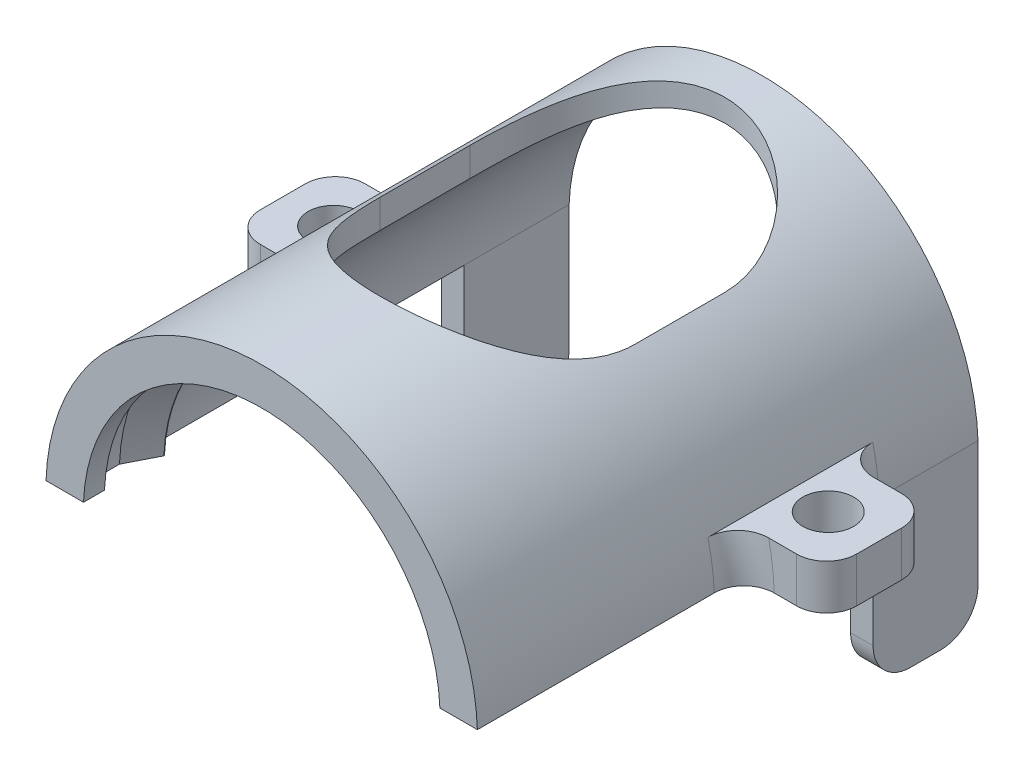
ISO-10303-21;
HEADER;
FILE_DESCRIPTION(('STEP AP214'),'2;1');
FILE_NAME('part.step','',(''),(''),'','','');
FILE_SCHEMA(('AUTOMOTIVE_DESIGN { 1 0 10303 214 1 1 1 1 }'));
ENDSEC;
DATA;
#1=APPLICATION_CONTEXT('core data for automotive mechanical design processes');
#2=APPLICATION_PROTOCOL_DEFINITION('international standard','automotive_design',2000,#1);
#3=PRODUCT_CONTEXT('',#1,'mechanical');
#4=PRODUCT('Part','Part','',(#3));
#5=PRODUCT_RELATED_PRODUCT_CATEGORY('part','',(#4));
#6=PRODUCT_DEFINITION_FORMATION('','',#4);
#7=PRODUCT_DEFINITION_CONTEXT('part definition',#1,'design');
#8=PRODUCT_DEFINITION('design','',#6,#7);
#9=PRODUCT_DEFINITION_SHAPE('','',#8);
#10=(LENGTH_UNIT() NAMED_UNIT(*) SI_UNIT(.MILLI.,.METRE.));
#11=(NAMED_UNIT(*) PLANE_ANGLE_UNIT() SI_UNIT($,.RADIAN.));
#12=(NAMED_UNIT(*) SI_UNIT($,.STERADIAN.) SOLID_ANGLE_UNIT());
#13=UNCERTAINTY_MEASURE_WITH_UNIT(LENGTH_MEASURE(1.E-05),#10,'distance_accuracy_value','');
#14=(GEOMETRIC_REPRESENTATION_CONTEXT(3) GLOBAL_UNCERTAINTY_ASSIGNED_CONTEXT((#13)) GLOBAL_UNIT_ASSIGNED_CONTEXT((#10,
#11,#12)) REPRESENTATION_CONTEXT('',''));
#15=CARTESIAN_POINT('',(0.,0.,0.));
#16=DIRECTION('',(0.,0.,1.));
#17=DIRECTION('',(1.,0.,0.));
#18=AXIS2_PLACEMENT_3D('',#15,#16,#17);
#19=CARTESIAN_POINT('',(0.,0.,1.));
#20=DIRECTION('',(0.,0.,-1.));
#21=DIRECTION('',(-1.,0.,0.));
#22=AXIS2_PLACEMENT_3D('',#19,#20,#21);
#23=CYLINDRICAL_SURFACE('',#22,14.4);
#24=DIRECTION('',(0.,0.,-1.));
#25=VECTOR('',#24,1.);
#26=CARTESIAN_POINT('',(-13.9681781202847,3.5,1.));
#27=LINE('',#26,#25);
#28=CARTESIAN_POINT('',(-13.9681781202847,3.5,-23.4));
#29=VERTEX_POINT('',#28);
#30=CARTESIAN_POINT('',(-13.9681781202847,3.5,-12.4));
#31=VERTEX_POINT('',#30);
#32=EDGE_CURVE('E761',#29,#31,#27,.F.);
#33=ORIENTED_EDGE('',*,*,#32,.T.);
#34=CARTESIAN_POINT('',(0.,0.,-12.4));
#35=DIRECTION('',(0.,0.,-1.));
#36=DIRECTION('',(-1.,0.,0.));
#37=AXIS2_PLACEMENT_3D('',#34,#35,#36);
#38=CIRCLE('',#37,14.4);
#39=CARTESIAN_POINT('',(-14.3913168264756,0.5,-12.4));
#40=VERTEX_POINT('',#39);
#41=EDGE_CURVE('E738',#31,#40,#38,.F.);
#42=ORIENTED_EDGE('',*,*,#41,.T.);
#43=DIRECTION('',(0.,0.,-1.));
#44=VECTOR('',#43,1.);
#45=CARTESIAN_POINT('',(-14.3913168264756,0.5,1.));
#46=LINE('',#45,#44);
#47=CARTESIAN_POINT('',(-14.3913168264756,0.5,3.4));
#48=VERTEX_POINT('',#47);
#49=EDGE_CURVE('E801',#48,#40,#46,.T.);
#50=ORIENTED_EDGE('',*,*,#49,.F.);
#51=CARTESIAN_POINT('',(0.,0.,3.4));
#52=DIRECTION('',(0.,0.,1.));
#53=DIRECTION('',(1.,0.,0.));
#54=AXIS2_PLACEMENT_3D('',#51,#52,#53);
#55=CIRCLE('',#54,14.4);
#56=CARTESIAN_POINT('',(14.3913168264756,0.5,3.4));
#57=VERTEX_POINT('',#56);
#58=EDGE_CURVE('E785',#57,#48,#55,.T.);
#59=ORIENTED_EDGE('',*,*,#58,.F.);
#60=DIRECTION('',(0.,0.,-1.));
#61=VECTOR('',#60,1.);
#62=CARTESIAN_POINT('',(14.3913168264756,0.5,1.));
#63=LINE('',#62,#61);
#64=CARTESIAN_POINT('',(14.3913168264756,0.5,-12.4));
#65=VERTEX_POINT('',#64);
#66=EDGE_CURVE('E811',#65,#57,#63,.F.);
#67=ORIENTED_EDGE('',*,*,#66,.F.);
#68=CARTESIAN_POINT('',(0.,0.,-12.4));
#69=DIRECTION('',(0.,0.,-1.));
#70=DIRECTION('',(-1.,0.,0.));
#71=AXIS2_PLACEMENT_3D('',#68,#69,#70);
#72=CIRCLE('',#71,14.4);
#73=CARTESIAN_POINT('',(13.9681781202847,3.5,-12.4));
#74=VERTEX_POINT('',#73);
#75=EDGE_CURVE('E749',#65,#74,#72,.F.);
#76=ORIENTED_EDGE('',*,*,#75,.T.);
#77=DIRECTION('',(0.,0.,-1.));
#78=VECTOR('',#77,1.);
#79=CARTESIAN_POINT('',(13.9681781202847,3.5,1.));
#80=LINE('',#79,#78);
#81=CARTESIAN_POINT('',(13.9681781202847,3.5,-23.4));
#82=VERTEX_POINT('',#81);
#83=EDGE_CURVE('E764',#74,#82,#80,.T.);
#84=ORIENTED_EDGE('',*,*,#83,.T.);
#85=CARTESIAN_POINT('',(0.,0.,-23.4));
#86=DIRECTION('',(0.,0.,1.));
#87=DIRECTION('',(1.,0.,0.));
#88=AXIS2_PLACEMENT_3D('',#85,#86,#87);
#89=CIRCLE('',#88,14.4);
#90=CARTESIAN_POINT('',(14.3913168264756,0.5,-23.4));
#91=VERTEX_POINT('',#90);
#92=EDGE_CURVE('E745',#82,#91,#89,.F.);
#93=ORIENTED_EDGE('',*,*,#92,.T.);
#94=CARTESIAN_POINT('',(14.3913168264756,0.5,-30.));
#95=VERTEX_POINT('',#94);
#96=EDGE_CURVE('E809',#95,#91,#63,.F.);
#97=ORIENTED_EDGE('',*,*,#96,.F.);
#98=CARTESIAN_POINT('',(0.,0.,-30.));
#99=DIRECTION('',(0.,0.,1.));
#100=DIRECTION('',(1.,0.,0.));
#101=AXIS2_PLACEMENT_3D('',#98,#99,#100);
#102=CIRCLE('',#101,14.4);
#103=CARTESIAN_POINT('',(-14.3913168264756,0.5,-30.));
#104=VERTEX_POINT('',#103);
#105=EDGE_CURVE('E793',#95,#104,#102,.T.);
#106=ORIENTED_EDGE('',*,*,#105,.T.);
#107=CARTESIAN_POINT('',(-14.3913168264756,0.5,-23.4));
#108=VERTEX_POINT('',#107);
#109=EDGE_CURVE('E805',#108,#104,#46,.T.);
#110=ORIENTED_EDGE('',*,*,#109,.F.);
#111=CARTESIAN_POINT('',(0.,0.,-23.4));
#112=DIRECTION('',(0.,0.,1.));
#113=DIRECTION('',(1.,0.,0.));
#114=AXIS2_PLACEMENT_3D('',#111,#112,#113);
#115=CIRCLE('',#114,14.4);
#116=EDGE_CURVE('E741',#108,#29,#115,.F.);
#117=ORIENTED_EDGE('',*,*,#116,.T.);
#118=EDGE_LOOP('',(#33,#42,#50,#59,#67,#76,#84,#93,#97,#106,#110,#117));
#119=FACE_BOUND('',#118,.T.);
#120=CARTESIAN_POINT('',(-8.5,11.6236827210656,-13.));
#121=CARTESIAN_POINT('',(-8.50000123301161,11.6236791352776,-12.8921078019));
#122=CARTESIAN_POINT('',(-8.4979452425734,11.6251856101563,-12.7842321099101));
#123=CARTESIAN_POINT('',(-8.48973669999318,11.6311825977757,-12.5687267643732));
#124=CARTESIAN_POINT('',(-8.4835844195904,11.6356729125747,-12.4610970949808));
#125=CARTESIAN_POINT('',(-8.45902879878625,11.6535517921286,-12.1391274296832));
#126=CARTESIAN_POINT('',(-8.43452658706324,11.6713484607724,-11.9254523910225));
#127=CARTESIAN_POINT('',(-8.36991955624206,11.7177641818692,-11.5034404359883));
#128=CARTESIAN_POINT('',(-8.32993724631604,11.7462982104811,-11.2950749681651));
#129=CARTESIAN_POINT('',(-8.23495444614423,11.8130813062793,-10.8833594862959));
#130=CARTESIAN_POINT('',(-8.17995109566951,11.8513322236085,-10.6800104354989));
#131=CARTESIAN_POINT('',(-8.05584722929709,11.9360352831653,-10.2802620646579));
#132=CARTESIAN_POINT('',(-7.98679763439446,11.9824577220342,-10.0838405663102));
#133=CARTESIAN_POINT('',(-7.83521281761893,12.0821217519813,-9.6981223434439));
#134=CARTESIAN_POINT('',(-7.75267797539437,12.1353631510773,-9.50882541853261));
#135=CARTESIAN_POINT('',(-7.48550754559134,12.3033108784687,-8.95192777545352));
#136=CARTESIAN_POINT('',(-7.2814896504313,12.4261095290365,-8.59590354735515));
#137=CARTESIAN_POINT('',(-6.79991449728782,12.6966877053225,-7.87958324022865));
#138=CARTESIAN_POINT('',(-6.51654452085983,12.8457087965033,-7.52366530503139));
#139=CARTESIAN_POINT('',(-6.05170715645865,13.0677659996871,-7.02686530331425));
#140=CARTESIAN_POINT('',(-5.89004112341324,13.1415754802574,-6.86737506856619));
#141=CARTESIAN_POINT('',(-5.55387306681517,13.2871367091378,-6.56135498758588));
#142=CARTESIAN_POINT('',(-5.37936846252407,13.3588880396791,-6.41482776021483));
#143=CARTESIAN_POINT('',(-4.99942291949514,13.5059792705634,-6.12109955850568));
#144=CARTESIAN_POINT('',(-4.79265196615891,13.5809164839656,-5.97541292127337));
#145=CARTESIAN_POINT('',(-4.36539468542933,13.7242145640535,-5.70222059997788));
#146=CARTESIAN_POINT('',(-4.1449145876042,13.7925783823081,-5.57470674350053));
#147=CARTESIAN_POINT('',(-3.69149050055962,13.9207894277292,-5.33918191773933));
#148=CARTESIAN_POINT('',(-3.45855101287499,13.98063970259,-5.23116396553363));
#149=CARTESIAN_POINT('',(-2.98176213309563,14.0900276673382,-5.03599247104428));
#150=CARTESIAN_POINT('',(-2.73791447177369,14.1395669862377,-4.94883563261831));
#151=CARTESIAN_POINT('',(-2.26443658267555,14.222679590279,-4.80379332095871));
#152=CARTESIAN_POINT('',(-2.03559436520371,14.2573095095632,-4.74393893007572));
#153=CARTESIAN_POINT('',(-1.57238628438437,14.3157980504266,-4.64334077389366));
#154=CARTESIAN_POINT('',(-1.33802073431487,14.3396572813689,-4.60259592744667));
#155=CARTESIAN_POINT('',(-0.865995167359,14.3758840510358,-4.54088266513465));
#156=CARTESIAN_POINT('',(-0.628337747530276,14.3882601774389,-4.51989947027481));
#157=CARTESIAN_POINT('',(-0.151787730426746,14.401171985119,-4.4980098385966));
#158=CARTESIAN_POINT('',(0.0871047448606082,14.4017088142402,-4.49710145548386));
#159=CARTESIAN_POINT('',(0.535128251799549,14.391582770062,-4.51426575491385));
#160=CARTESIAN_POINT('',(0.744381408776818,14.3822598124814,-4.53006755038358));
#161=CARTESIAN_POINT('',(1.1605671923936,14.3546706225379,-4.57699987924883));
#162=CARTESIAN_POINT('',(1.36749982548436,14.3364044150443,-4.60813037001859));
#163=CARTESIAN_POINT('',(1.77760015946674,14.2913504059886,-4.68533360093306));
#164=CARTESIAN_POINT('',(1.98076793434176,14.2645627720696,-4.73140604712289));
#165=CARTESIAN_POINT('',(2.38205711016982,14.2030637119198,-4.8379592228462));
#166=CARTESIAN_POINT('',(2.58017830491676,14.1683519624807,-4.89844054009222));
#167=CARTESIAN_POINT('',(2.97154579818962,14.0914845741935,-5.03362987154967));
#168=CARTESIAN_POINT('',(3.16475081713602,14.0492808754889,-5.10842999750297));
#169=CARTESIAN_POINT('',(3.54395300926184,13.958455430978,-5.27128533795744));
#170=CARTESIAN_POINT('',(3.72994775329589,13.9098315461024,-5.35934497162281));
#171=CARTESIAN_POINT('',(4.27576187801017,13.7557424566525,-5.64230950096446));
#172=CARTESIAN_POINT('',(4.62367570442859,13.6420058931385,-5.85609246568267));
#173=CARTESIAN_POINT('',(5.32080405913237,13.3866654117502,-6.35588159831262));
#174=CARTESIAN_POINT('',(5.66538964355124,13.2433576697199,-6.64741652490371));
#175=CARTESIAN_POINT('',(6.30392041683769,12.9515963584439,-7.28048271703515));
#176=CARTESIAN_POINT('',(6.59778666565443,12.8031351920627,-7.62209041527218));
#177=CARTESIAN_POINT('',(7.01111488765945,12.5790550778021,-8.18783013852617));
#178=CARTESIAN_POINT('',(7.15008046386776,12.5003614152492,-8.39677758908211));
#179=CARTESIAN_POINT('',(7.40977786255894,12.348190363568,-8.82765829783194));
#180=CARTESIAN_POINT('',(7.53050680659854,12.2747137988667,-9.04959359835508));
#181=CARTESIAN_POINT('',(7.75219851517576,12.1359174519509,-9.50467483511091));
#182=CARTESIAN_POINT('',(7.8532204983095,12.0705734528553,-9.7377844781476));
#183=CARTESIAN_POINT('',(8.03467500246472,11.9505584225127,-10.2145071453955));
#184=CARTESIAN_POINT('',(8.115115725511,11.8958831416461,-10.4581159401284));
#185=CARTESIAN_POINT('',(8.23611972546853,11.8122922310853,-10.8898387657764));
#186=CARTESIAN_POINT('',(8.28161567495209,11.7803718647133,-11.0760027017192));
#187=CARTESIAN_POINT('',(8.36008366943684,11.7248157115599,-11.4521328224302));
#188=CARTESIAN_POINT('',(8.39305968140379,11.7011773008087,-11.64209778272));
#189=CARTESIAN_POINT('',(8.44623503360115,11.6628581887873,-12.0259171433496));
#190=CARTESIAN_POINT('',(8.46635444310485,11.6482335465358,-12.2197882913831));
#191=CARTESIAN_POINT('',(8.49325896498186,11.6286114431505,-12.6090954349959));
#192=CARTESIAN_POINT('',(8.50003298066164,11.6236219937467,-12.8045325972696));
#193=CARTESIAN_POINT('',(8.5,11.6236827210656,-13.));
#194=B_SPLINE_CURVE_WITH_KNOTS('',3,(#120,#121,#122,#123,#124,#125,#126,#127,#128,#129,#130,
#131,#132,#133,#134,#135,#136,#137,#138,#139,#140,#141,#142,#143,#144,#145,#146,#147,#148,#149,
#150,#151,#152,#153,#154,#155,#156,#157,#158,#159,#160,#161,#162,#163,#164,#165,#166,#167,#168,
#169,#170,#171,#172,#173,#174,#175,#176,#177,#178,#179,#180,#181,#182,#183,#184,#185,#186,#187,
#188,#189,#190,#191,#192,#193),.UNSPECIFIED.,.F.,.F.,(4,2,2,2,2,2,2,2,2,2,2,2,2,2,2,2,2,2,2,2,2,
2,2,2,2,2,2,2,2,2,2,2,2,2,2,2,4),(0.,0.323614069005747,0.647206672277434,1.29363176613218,
1.93504232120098,2.57657509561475,3.21582233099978,3.85505157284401,5.13536675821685,
6.56554902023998,7.28134878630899,7.99729283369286,8.78768469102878,9.57771997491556,
10.3674717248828,11.1570986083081,11.8732599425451,12.5893807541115,13.3049655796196,
14.0204810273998,14.6498966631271,15.2793105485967,15.9087120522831,16.5381392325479,
17.1717604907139,17.8055933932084,19.0724119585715,20.4877410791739,21.905253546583,
22.6933859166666,23.4816425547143,24.2674927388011,25.0530292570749,25.6353151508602,
26.2174163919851,26.8031022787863,27.3892749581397),.UNSPECIFIED.);
#195=CARTESIAN_POINT('',(-8.5,11.6236827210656,-13.));
#196=VERTEX_POINT('',#195);
#197=CARTESIAN_POINT('',(8.5,11.6236827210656,-13.));
#198=VERTEX_POINT('',#197);
#199=EDGE_CURVE('E336',#196,#198,#194,.T.);
#200=ORIENTED_EDGE('',*,*,#199,.F.);
#201=DIRECTION('',(0.,0.,-1.));
#202=VECTOR('',#201,1.);
#203=CARTESIAN_POINT('',(-8.5,11.6236827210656,1.));
#204=LINE('',#203,#202);
#205=CARTESIAN_POINT('',(-8.5,11.6236827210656,-19.));
#206=VERTEX_POINT('',#205);
#207=EDGE_CURVE('E324',#206,#196,#204,.F.);
#208=ORIENTED_EDGE('',*,*,#207,.F.);
#209=CARTESIAN_POINT('',(8.5,11.6236827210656,-19.));
#210=CARTESIAN_POINT('',(8.50000123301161,11.6236791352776,-19.1078921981));
#211=CARTESIAN_POINT('',(8.4979452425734,11.6251856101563,-19.2157678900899));
#212=CARTESIAN_POINT('',(8.48973669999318,11.6311825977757,-19.4312732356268));
#213=CARTESIAN_POINT('',(8.48358441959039,11.6356729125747,-19.5389029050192));
#214=CARTESIAN_POINT('',(8.45902879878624,11.6535517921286,-19.8608725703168));
#215=CARTESIAN_POINT('',(8.43452658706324,11.6713484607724,-20.0745476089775));
#216=CARTESIAN_POINT('',(8.36991955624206,11.7177641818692,-20.4965595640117));
#217=CARTESIAN_POINT('',(8.32993724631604,11.7462982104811,-20.7049250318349));
#218=CARTESIAN_POINT('',(8.23495444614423,11.8130813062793,-21.1166405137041));
#219=CARTESIAN_POINT('',(8.17995109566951,11.8513322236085,-21.3199895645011));
#220=CARTESIAN_POINT('',(8.05584722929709,11.9360352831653,-21.7197379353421));
#221=CARTESIAN_POINT('',(7.98679763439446,11.9824577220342,-21.9161594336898));
#222=CARTESIAN_POINT('',(7.83521281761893,12.0821217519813,-22.3018776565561));
#223=CARTESIAN_POINT('',(7.75267797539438,12.1353631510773,-22.4911745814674));
#224=CARTESIAN_POINT('',(7.48550754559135,12.3033108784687,-23.0480722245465));
#225=CARTESIAN_POINT('',(7.2814896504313,12.4261095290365,-23.4040964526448));
#226=CARTESIAN_POINT('',(6.79991449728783,12.6966877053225,-24.1204167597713));
#227=CARTESIAN_POINT('',(6.51654452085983,12.8457087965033,-24.4763346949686));
#228=CARTESIAN_POINT('',(6.05170715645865,13.0677659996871,-24.9731346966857));
#229=CARTESIAN_POINT('',(5.89004112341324,13.1415754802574,-25.1326249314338));
#230=CARTESIAN_POINT('',(5.55387306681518,13.2871367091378,-25.4386450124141));
#231=CARTESIAN_POINT('',(5.37936846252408,13.3588880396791,-25.5851722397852));
#232=CARTESIAN_POINT('',(4.99942291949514,13.5059792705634,-25.8789004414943));
#233=CARTESIAN_POINT('',(4.79265196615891,13.5809164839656,-26.0245870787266));
#234=CARTESIAN_POINT('',(4.36539468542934,13.7242145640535,-26.2977794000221));
#235=CARTESIAN_POINT('',(4.14491458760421,13.7925783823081,-26.4252932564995));
#236=CARTESIAN_POINT('',(3.69149050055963,13.9207894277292,-26.6608180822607));
#237=CARTESIAN_POINT('',(3.458551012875,13.98063970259,-26.7688360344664));
#238=CARTESIAN_POINT('',(2.98176213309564,14.0900276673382,-26.9640075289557));
#239=CARTESIAN_POINT('',(2.73791447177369,14.1395669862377,-27.0511643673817));
#240=CARTESIAN_POINT('',(2.26443658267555,14.222679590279,-27.1962066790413));
#241=CARTESIAN_POINT('',(2.03559436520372,14.2573095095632,-27.2560610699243));
#242=CARTESIAN_POINT('',(1.57238628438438,14.3157980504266,-27.3566592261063));
#243=CARTESIAN_POINT('',(1.33802073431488,14.3396572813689,-27.3974040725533));
#244=CARTESIAN_POINT('',(0.865995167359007,14.3758840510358,-27.4591173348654));
#245=CARTESIAN_POINT('',(0.628337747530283,14.3882601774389,-27.4801005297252));
#246=CARTESIAN_POINT('',(0.151787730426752,14.401171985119,-27.5019901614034));
#247=CARTESIAN_POINT('',(-0.0871047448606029,14.4017088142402,-27.5028985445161));
#248=CARTESIAN_POINT('',(-0.535128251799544,14.391582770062,-27.4857342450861));
#249=CARTESIAN_POINT('',(-0.744381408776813,14.3822598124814,-27.4699324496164));
#250=CARTESIAN_POINT('',(-1.1605671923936,14.3546706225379,-27.4230001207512));
#251=CARTESIAN_POINT('',(-1.36749982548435,14.3364044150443,-27.3918696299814));
#252=CARTESIAN_POINT('',(-1.77760015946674,14.2913504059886,-27.3146663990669));
#253=CARTESIAN_POINT('',(-1.98076793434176,14.2645627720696,-27.2685939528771));
#254=CARTESIAN_POINT('',(-2.38205711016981,14.2030637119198,-27.1620407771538));
#255=CARTESIAN_POINT('',(-2.58017830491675,14.1683519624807,-27.1015594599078));
#256=CARTESIAN_POINT('',(-2.97154579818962,14.0914845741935,-26.9663701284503));
#257=CARTESIAN_POINT('',(-3.16475081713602,14.0492808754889,-26.891570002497));
#258=CARTESIAN_POINT('',(-3.54395300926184,13.958455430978,-26.7287146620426));
#259=CARTESIAN_POINT('',(-3.72994775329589,13.9098315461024,-26.6406550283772));
#260=CARTESIAN_POINT('',(-4.27576187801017,13.7557424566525,-26.3576904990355));
#261=CARTESIAN_POINT('',(-4.62367570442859,13.6420058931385,-26.1439075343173));
#262=CARTESIAN_POINT('',(-5.32080405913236,13.3866654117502,-25.6441184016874));
#263=CARTESIAN_POINT('',(-5.66538964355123,13.2433576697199,-25.3525834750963));
#264=CARTESIAN_POINT('',(-6.30392041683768,12.9515963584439,-24.7195172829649));
#265=CARTESIAN_POINT('',(-6.59778666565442,12.8031351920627,-24.3779095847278));
#266=CARTESIAN_POINT('',(-7.01111488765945,12.5790550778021,-23.8121698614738));
#267=CARTESIAN_POINT('',(-7.15008046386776,12.5003614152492,-23.6032224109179));
#268=CARTESIAN_POINT('',(-7.40977786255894,12.348190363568,-23.1723417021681));
#269=CARTESIAN_POINT('',(-7.53050680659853,12.2747137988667,-22.9504064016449));
#270=CARTESIAN_POINT('',(-7.75219851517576,12.1359174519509,-22.4953251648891));
#271=CARTESIAN_POINT('',(-7.8532204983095,12.0705734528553,-22.2622155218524));
#272=CARTESIAN_POINT('',(-8.03467500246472,11.9505584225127,-21.7854928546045));
#273=CARTESIAN_POINT('',(-8.115115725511,11.8958831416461,-21.5418840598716));
#274=CARTESIAN_POINT('',(-8.23611972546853,11.8122922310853,-21.1101612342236));
#275=CARTESIAN_POINT('',(-8.28161567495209,11.7803718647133,-20.9239972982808));
#276=CARTESIAN_POINT('',(-8.36008366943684,11.7248157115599,-20.5478671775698));
#277=CARTESIAN_POINT('',(-8.39305968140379,11.7011773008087,-20.35790221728));
#278=CARTESIAN_POINT('',(-8.44623503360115,11.6628581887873,-19.9740828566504));
#279=CARTESIAN_POINT('',(-8.46635444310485,11.6482335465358,-19.7802117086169));
#280=CARTESIAN_POINT('',(-8.49325896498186,11.6286114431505,-19.3909045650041));
#281=CARTESIAN_POINT('',(-8.50003298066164,11.6236219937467,-19.1954674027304));
#282=CARTESIAN_POINT('',(-8.5,11.6236827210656,-19.));
#283=B_SPLINE_CURVE_WITH_KNOTS('',3,(#209,#210,#211,#212,#213,#214,#215,#216,#217,#218,#219,
#220,#221,#222,#223,#224,#225,#226,#227,#228,#229,#230,#231,#232,#233,#234,#235,#236,#237,#238,
#239,#240,#241,#242,#243,#244,#245,#246,#247,#248,#249,#250,#251,#252,#253,#254,#255,#256,#257,
#258,#259,#260,#261,#262,#263,#264,#265,#266,#267,#268,#269,#270,#271,#272,#273,#274,#275,#276,
#277,#278,#279,#280,#281,#282),.UNSPECIFIED.,.F.,.F.,(4,2,2,2,2,2,2,2,2,2,2,2,2,2,2,2,2,2,2,2,2,
2,2,2,2,2,2,2,2,2,2,2,2,2,2,2,4),(0.,0.32361406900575,0.647206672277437,1.29363176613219,
1.93504232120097,2.57657509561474,3.21582233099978,3.85505157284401,5.13536675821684,
6.56554902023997,7.28134878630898,7.99729283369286,8.78768469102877,9.57771997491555,
10.3674717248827,11.1570986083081,11.8732599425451,12.5893807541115,13.3049655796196,
14.0204810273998,14.6498966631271,15.2793105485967,15.9087120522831,16.5381392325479,
17.1717604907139,17.8055933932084,19.0724119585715,20.4877410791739,21.905253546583,
22.6933859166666,23.4816425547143,24.2674927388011,25.0530292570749,25.6353151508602,
26.2174163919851,26.8031022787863,27.3892749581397),.UNSPECIFIED.);
#284=CARTESIAN_POINT('',(8.5,11.6236827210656,-19.));
#285=VERTEX_POINT('',#284);
#286=EDGE_CURVE('E330',#285,#206,#283,.T.);
#287=ORIENTED_EDGE('',*,*,#286,.F.);
#288=DIRECTION('',(0.,0.,-1.));
#289=VECTOR('',#288,1.);
#290=CARTESIAN_POINT('',(8.5,11.6236827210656,0.999999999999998));
#291=LINE('',#290,#289);
#292=EDGE_CURVE('E343',#198,#285,#291,.T.);
#293=ORIENTED_EDGE('',*,*,#292,.F.);
#294=EDGE_LOOP('',(#200,#208,#287,#293));
#295=FACE_BOUND('',#294,.T.);
#296=ADVANCED_FACE('F64',(#119,#295),#23,.T.);
#297=CARTESIAN_POINT('',(0.,0.,-30.));
#298=DIRECTION('',(0.,0.,1.));
#299=DIRECTION('',(1.,0.,0.));
#300=AXIS2_PLACEMENT_3D('',#297,#298,#299);
#301=CYLINDRICAL_SURFACE('',#300,12.9);
#302=DIRECTION('',(0.,0.,1.));
#303=VECTOR('',#302,1.);
#304=CARTESIAN_POINT('',(12.8903064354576,0.5,-30.));
#305=LINE('',#304,#303);
#306=CARTESIAN_POINT('',(12.8903064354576,0.5,-3.));
#307=VERTEX_POINT('',#306);
#308=CARTESIAN_POINT('',(12.8903064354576,0.5,-23.));
#309=VERTEX_POINT('',#308);
#310=EDGE_CURVE('E767',#307,#309,#305,.F.);
#311=ORIENTED_EDGE('',*,*,#310,.F.);
#312=CARTESIAN_POINT('',(0.,0.,-3.));
#313=DIRECTION('',(0.,0.,1.));
#314=DIRECTION('',(1.,0.,0.));
#315=AXIS2_PLACEMENT_3D('',#312,#313,#314);
#316=CIRCLE('',#315,12.9);
#317=CARTESIAN_POINT('',(-12.8903064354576,0.5,-3.));
#318=VERTEX_POINT('',#317);
#319=EDGE_CURVE('E667',#307,#318,#316,.T.);
#320=ORIENTED_EDGE('',*,*,#319,.T.);
#321=DIRECTION('',(0.,0.,1.));
#322=VECTOR('',#321,1.);
#323=CARTESIAN_POINT('',(-12.8903064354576,0.5,-30.));
#324=LINE('',#323,#322);
#325=CARTESIAN_POINT('',(-12.8903064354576,0.5,-23.));
#326=VERTEX_POINT('',#325);
#327=EDGE_CURVE('E775',#326,#318,#324,.T.);
#328=ORIENTED_EDGE('',*,*,#327,.F.);
#329=CARTESIAN_POINT('',(-12.8903064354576,0.5,-30.));
#330=VERTEX_POINT('',#329);
#331=EDGE_CURVE('E771',#330,#326,#324,.T.);
#332=ORIENTED_EDGE('',*,*,#331,.F.);
#333=CARTESIAN_POINT('',(0.,0.,-30.));
#334=DIRECTION('',(0.,0.,1.));
#335=DIRECTION('',(1.,0.,0.));
#336=AXIS2_PLACEMENT_3D('',#333,#334,#335);
#337=CIRCLE('',#336,12.9);
#338=CARTESIAN_POINT('',(12.8903064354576,0.5,-30.));
#339=VERTEX_POINT('',#338);
#340=EDGE_CURVE('E797',#339,#330,#337,.T.);
#341=ORIENTED_EDGE('',*,*,#340,.F.);
#342=DIRECTION('',(0.,0.,-1.));
#343=VECTOR('',#342,1.);
#344=CARTESIAN_POINT('',(12.8903064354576,0.5,-30.));
#345=LINE('',#344,#343);
#346=EDGE_CURVE('E345',#309,#339,#345,.T.);
#347=ORIENTED_EDGE('',*,*,#346,.F.);
#348=EDGE_LOOP('',(#311,#320,#328,#332,#341,#347));
#349=FACE_BOUND('',#348,.T.);
#350=CARTESIAN_POINT('',(8.5,9.70360757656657,-13.));
#351=CARTESIAN_POINT('',(8.50000161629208,9.70360284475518,-12.8951579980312));
#352=CARTESIAN_POINT('',(8.49805971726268,9.70530756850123,-12.7903334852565));
#353=CARTESIAN_POINT('',(8.4903101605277,9.7120889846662,-12.5809464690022));
#354=CARTESIAN_POINT('',(8.48450287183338,9.71716535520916,-12.4763839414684));
#355=CARTESIAN_POINT('',(8.46133809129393,9.73736125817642,-12.1637213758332));
#356=CARTESIAN_POINT('',(8.4382375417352,9.75744787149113,-11.95632186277));
#357=CARTESIAN_POINT('',(8.37747913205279,9.8096590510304,-11.5473456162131));
#358=CARTESIAN_POINT('',(8.33996364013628,9.84166579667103,-11.3457320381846));
#359=CARTESIAN_POINT('',(8.25101232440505,9.91635830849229,-10.9475825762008));
#360=CARTESIAN_POINT('',(8.19957262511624,9.95904704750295,-10.7510481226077));
#361=CARTESIAN_POINT('',(8.08380694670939,10.053237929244,-10.3651469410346));
#362=CARTESIAN_POINT('',(8.0195471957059,10.1046945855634,-10.1757490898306));
#363=CARTESIAN_POINT('',(7.8787122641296,10.2148857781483,-9.80384011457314));
#364=CARTESIAN_POINT('',(7.80213767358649,10.273619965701,-9.62132866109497));
#365=CARTESIAN_POINT('',(7.55449897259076,10.4585848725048,-9.08395648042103));
#366=CARTESIAN_POINT('',(7.36576472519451,10.5933695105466,-8.74006078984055));
#367=CARTESIAN_POINT('',(6.91379759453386,10.8946619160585,-8.03510577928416));
#368=CARTESIAN_POINT('',(6.64363182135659,11.0628932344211,-7.67923185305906));
#369=CARTESIAN_POINT('',(6.19919371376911,11.3141129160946,-7.18023810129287));
#370=CARTESIAN_POINT('',(6.04443018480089,11.3977058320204,-7.01963917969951));
#371=CARTESIAN_POINT('',(5.72211172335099,11.5628797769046,-6.71054046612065));
#372=CARTESIAN_POINT('',(5.55455387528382,11.6444603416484,-6.56204344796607));
#373=CARTESIAN_POINT('',(5.18273138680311,11.8151097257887,-6.25798314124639));
#374=CARTESIAN_POINT('',(4.97661740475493,11.9036197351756,-6.10435950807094));
#375=CARTESIAN_POINT('',(4.5493288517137,12.0733764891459,-5.81528723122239));
#376=CARTESIAN_POINT('',(4.32816133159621,12.1546265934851,-5.67983016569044));
#377=CARTESIAN_POINT('',(3.87188679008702,12.3075730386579,-5.42858795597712));
#378=CARTESIAN_POINT('',(3.63678598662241,12.3792735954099,-5.31279412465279));
#379=CARTESIAN_POINT('',(3.1541140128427,12.510958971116,-5.10248010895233));
#380=CARTESIAN_POINT('',(2.90654544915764,12.5709462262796,-5.00795550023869));
#381=CARTESIAN_POINT('',(2.42885923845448,12.6713647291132,-4.85096913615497));
#382=CARTESIAN_POINT('',(2.19982465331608,12.7132225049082,-4.78612206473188));
#383=CARTESIAN_POINT('',(1.73531761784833,12.7849079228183,-4.67559944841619));
#384=CARTESIAN_POINT('',(1.49984559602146,12.8147363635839,-4.62992263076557));
#385=CARTESIAN_POINT('',(1.02485862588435,12.8614368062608,-4.55859710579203));
#386=CARTESIAN_POINT('',(0.785348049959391,12.8783220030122,-4.53292800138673));
#387=CARTESIAN_POINT('',(0.304455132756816,12.8986508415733,-4.50203946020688));
#388=CARTESIAN_POINT('',(0.0630730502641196,12.9020963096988,-4.49681724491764));
#389=CARTESIAN_POINT('',(-0.383126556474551,12.895943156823,-4.5061581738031));
#390=CARTESIAN_POINT('',(-0.588036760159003,12.8882104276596,-4.51789103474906));
#391=CARTESIAN_POINT('',(-0.995889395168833,12.8631230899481,-4.55605868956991));
#392=CARTESIAN_POINT('',(-1.19883186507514,12.84576867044,-4.5824931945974));
#393=CARTESIAN_POINT('',(-1.60129936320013,12.801828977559,-4.64970238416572));
#394=CARTESIAN_POINT('',(-1.80082442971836,12.775243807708,-4.69047690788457));
#395=CARTESIAN_POINT('',(-2.19517078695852,12.7134207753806,-4.78584244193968));
#396=CARTESIAN_POINT('',(-2.3899918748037,12.6781825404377,-4.8404340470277));
#397=CARTESIAN_POINT('',(-2.77324274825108,12.5998911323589,-4.96262153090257));
#398=CARTESIAN_POINT('',(-2.96168955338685,12.5568611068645,-5.03017892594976));
#399=CARTESIAN_POINT('',(-3.33188490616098,12.4637488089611,-5.17770530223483));
#400=CARTESIAN_POINT('',(-3.51363122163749,12.4136642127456,-5.25767837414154));
#401=CARTESIAN_POINT('',(-4.04752243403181,12.2541917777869,-5.51511691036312));
#402=CARTESIAN_POINT('',(-4.38859526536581,12.1355269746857,-5.71019081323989));
#403=CARTESIAN_POINT('',(-5.07848392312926,11.8648173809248,-6.16971479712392));
#404=CARTESIAN_POINT('',(-5.42252048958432,11.7104379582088,-6.43989201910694));
#405=CARTESIAN_POINT('',(-6.06353474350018,11.3917380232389,-7.02732953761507));
#406=CARTESIAN_POINT('',(-6.36044059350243,11.2274028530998,-7.34466030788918));
#407=CARTESIAN_POINT('',(-6.7878828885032,10.971232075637,-7.87779587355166));
#408=CARTESIAN_POINT('',(-6.9355597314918,10.8782187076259,-8.0795527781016));
#409=CARTESIAN_POINT('',(-7.21334595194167,10.6960360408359,-8.49662273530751));
#410=CARTESIAN_POINT('',(-7.34345132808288,10.606867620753,-8.71193885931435));
#411=CARTESIAN_POINT('',(-7.58492234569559,10.4355576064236,-9.15518591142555));
#412=CARTESIAN_POINT('',(-7.6963072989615,10.3534088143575,-9.38310351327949));
#413=CARTESIAN_POINT('',(-7.8992460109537,10.1994186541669,-9.8508993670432));
#414=CARTESIAN_POINT('',(-7.99080968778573,10.127572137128,-10.090771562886));
#415=CARTESIAN_POINT('',(-8.13032702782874,10.0156591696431,-10.5134876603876));
#416=CARTESIAN_POINT('',(-8.18334228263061,9.97229419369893,-10.6938008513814));
#417=CARTESIAN_POINT('',(-8.27763202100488,9.89416812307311,-11.0592796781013));
#418=CARTESIAN_POINT('',(-8.31890982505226,9.85940459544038,-11.2444439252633));
#419=CARTESIAN_POINT('',(-8.38907278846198,9.79977435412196,-11.6181499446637));
#420=CARTESIAN_POINT('',(-8.41799124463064,9.77488106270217,-11.806681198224));
#421=CARTESIAN_POINT('',(-8.46311751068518,9.73583822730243,-12.1862893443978));
#422=CARTESIAN_POINT('',(-8.47933346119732,9.72168180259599,-12.3773645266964));
#423=CARTESIAN_POINT('',(-8.49270768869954,9.70999123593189,-12.6407095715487));
#424=CARTESIAN_POINT('',(-8.49544205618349,9.70759855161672,-12.7125349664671));
#425=CARTESIAN_POINT('',(-8.49908772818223,9.70440694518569,-12.8562372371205));
#426=CARTESIAN_POINT('',(-8.49999979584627,9.70360735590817,-12.9281140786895));
#427=CARTESIAN_POINT('',(-8.5,9.70360757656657,-13.));
#428=B_SPLINE_CURVE_WITH_KNOTS('',3,(#350,#351,#352,#353,#354,#355,#356,#357,#358,#359,#360,
#361,#362,#363,#364,#365,#366,#367,#368,#369,#370,#371,#372,#373,#374,#375,#376,#377,#378,#379,
#380,#381,#382,#383,#384,#385,#386,#387,#388,#389,#390,#391,#392,#393,#394,#395,#396,#397,#398,
#399,#400,#401,#402,#403,#404,#405,#406,#407,#408,#409,#410,#411,#412,#413,#414,#415,#416,#417,
#418,#419,#420,#421,#422,#423,#424,#425,#426,#427),.UNSPECIFIED.,.F.,.F.,(4,2,2,2,2,2,2,2,2,2,2,
2,2,2,2,2,2,2,2,2,2,2,2,2,2,2,2,2,2,2,2,2,2,2,2,2,2,2,4),(0.,0.314460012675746,
0.628890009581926,1.25678073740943,1.87862324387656,2.50063900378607,3.11952098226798,
3.73837331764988,4.97864660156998,6.405281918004,7.11930346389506,7.8334882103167,
8.64803853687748,9.46220993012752,10.2760206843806,11.0896619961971,11.8136472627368,
12.5375844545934,13.2607826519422,13.9838825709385,14.5993118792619,15.2147290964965,
15.8301394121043,16.4455762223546,17.0592138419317,17.6730540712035,18.8998570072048,
20.2864731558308,21.6751829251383,22.4746950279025,23.2743888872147,24.0732526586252,
24.8717157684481,25.4498240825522,26.0277686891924,26.6041463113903,27.1801542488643,
27.3958740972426,27.6115035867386),.UNSPECIFIED.);
#429=CARTESIAN_POINT('',(8.5,9.70360757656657,-13.));
#430=VERTEX_POINT('',#429);
#431=CARTESIAN_POINT('',(-8.50000000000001,9.70360757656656,-13.));
#432=VERTEX_POINT('',#431);
#433=EDGE_CURVE('E12',#430,#432,#428,.T.);
#434=ORIENTED_EDGE('',*,*,#433,.F.);
#435=DIRECTION('',(0.,0.,1.));
#436=VECTOR('',#435,1.);
#437=CARTESIAN_POINT('',(8.49999999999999,9.70360757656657,-30.));
#438=LINE('',#437,#436);
#439=CARTESIAN_POINT('',(8.5,9.70360757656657,-19.));
#440=VERTEX_POINT('',#439);
#441=EDGE_CURVE('E79',#440,#430,#438,.T.);
#442=ORIENTED_EDGE('',*,*,#441,.F.);
#443=CARTESIAN_POINT('',(-8.5,9.70360757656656,-19.));
#444=CARTESIAN_POINT('',(-8.50000161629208,9.70360284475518,-19.1048420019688));
#445=CARTESIAN_POINT('',(-8.49805971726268,9.70530756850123,-19.2096665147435));
#446=CARTESIAN_POINT('',(-8.4903101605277,9.7120889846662,-19.4190535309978));
#447=CARTESIAN_POINT('',(-8.48450287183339,9.71716535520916,-19.5236160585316));
#448=CARTESIAN_POINT('',(-8.46133809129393,9.73736125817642,-19.8362786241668));
#449=CARTESIAN_POINT('',(-8.4382375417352,9.75744787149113,-20.04367813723));
#450=CARTESIAN_POINT('',(-8.37747913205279,9.8096590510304,-20.4526543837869));
#451=CARTESIAN_POINT('',(-8.33996364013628,9.84166579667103,-20.6542679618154));
#452=CARTESIAN_POINT('',(-8.25101232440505,9.91635830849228,-21.0524174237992));
#453=CARTESIAN_POINT('',(-8.19957262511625,9.95904704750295,-21.2489518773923));
#454=CARTESIAN_POINT('',(-8.08380694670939,10.053237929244,-21.6348530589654));
#455=CARTESIAN_POINT('',(-8.0195471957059,10.1046945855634,-21.8242509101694));
#456=CARTESIAN_POINT('',(-7.8787122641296,10.2148857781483,-22.1961598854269));
#457=CARTESIAN_POINT('',(-7.80213767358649,10.273619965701,-22.378671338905));
#458=CARTESIAN_POINT('',(-7.55449897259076,10.4585848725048,-22.916043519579));
#459=CARTESIAN_POINT('',(-7.3657647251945,10.5933695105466,-23.2599392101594));
#460=CARTESIAN_POINT('',(-6.91379759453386,10.8946619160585,-23.9648942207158));
#461=CARTESIAN_POINT('',(-6.64363182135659,11.0628932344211,-24.3207681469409));
#462=CARTESIAN_POINT('',(-6.19919371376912,11.3141129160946,-24.8197618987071));
#463=CARTESIAN_POINT('',(-6.0444301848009,11.3977058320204,-24.9803608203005));
#464=CARTESIAN_POINT('',(-5.72211172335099,11.5628797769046,-25.2894595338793));
#465=CARTESIAN_POINT('',(-5.55455387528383,11.6444603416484,-25.4379565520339));
#466=CARTESIAN_POINT('',(-5.18273138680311,11.8151097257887,-25.7420168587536));
#467=CARTESIAN_POINT('',(-4.97661740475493,11.9036197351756,-25.8956404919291));
#468=CARTESIAN_POINT('',(-4.5493288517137,12.0733764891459,-26.1847127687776));
#469=CARTESIAN_POINT('',(-4.32816133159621,12.1546265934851,-26.3201698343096));
#470=CARTESIAN_POINT('',(-3.87188679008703,12.3075730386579,-26.5714120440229));
#471=CARTESIAN_POINT('',(-3.63678598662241,12.3792735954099,-26.6872058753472));
#472=CARTESIAN_POINT('',(-3.1541140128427,12.510958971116,-26.8975198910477));
#473=CARTESIAN_POINT('',(-2.90654544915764,12.5709462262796,-26.9920444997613));
#474=CARTESIAN_POINT('',(-2.42885923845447,12.6713647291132,-27.149030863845));
#475=CARTESIAN_POINT('',(-2.19982465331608,12.7132225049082,-27.2138779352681));
#476=CARTESIAN_POINT('',(-1.73531761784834,12.7849079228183,-27.3244005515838));
#477=CARTESIAN_POINT('',(-1.49984559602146,12.8147363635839,-27.3700773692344));
#478=CARTESIAN_POINT('',(-1.02485862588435,12.8614368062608,-27.441402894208));
#479=CARTESIAN_POINT('',(-0.785348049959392,12.8783220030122,-27.4670719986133));
#480=CARTESIAN_POINT('',(-0.304455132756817,12.8986508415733,-27.4979605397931));
#481=CARTESIAN_POINT('',(-0.0630730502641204,12.9020963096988,-27.5031827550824));
#482=CARTESIAN_POINT('',(0.383126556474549,12.895943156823,-27.4938418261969));
#483=CARTESIAN_POINT('',(0.588036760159,12.8882104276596,-27.4821089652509));
#484=CARTESIAN_POINT('',(0.99588939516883,12.8631230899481,-27.4439413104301));
#485=CARTESIAN_POINT('',(1.19883186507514,12.84576867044,-27.4175068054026));
#486=CARTESIAN_POINT('',(1.60129936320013,12.801828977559,-27.3502976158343));
#487=CARTESIAN_POINT('',(1.80082442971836,12.775243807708,-27.3095230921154));
#488=CARTESIAN_POINT('',(2.19517078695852,12.7134207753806,-27.2141575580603));
#489=CARTESIAN_POINT('',(2.3899918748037,12.6781825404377,-27.1595659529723));
#490=CARTESIAN_POINT('',(2.77324274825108,12.5998911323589,-27.0373784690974));
#491=CARTESIAN_POINT('',(2.96168955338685,12.5568611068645,-26.9698210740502));
#492=CARTESIAN_POINT('',(3.33188490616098,12.4637488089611,-26.8222946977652));
#493=CARTESIAN_POINT('',(3.51363122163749,12.4136642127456,-26.7423216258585));
#494=CARTESIAN_POINT('',(4.04752243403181,12.2541917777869,-26.4848830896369));
#495=CARTESIAN_POINT('',(4.38859526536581,12.1355269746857,-26.2898091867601));
#496=CARTESIAN_POINT('',(5.07848392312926,11.8648173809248,-25.8302852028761));
#497=CARTESIAN_POINT('',(5.42252048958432,11.7104379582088,-25.5601079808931));
#498=CARTESIAN_POINT('',(6.06353474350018,11.3917380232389,-24.9726704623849));
#499=CARTESIAN_POINT('',(6.36044059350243,11.2274028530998,-24.6553396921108));
#500=CARTESIAN_POINT('',(6.7878828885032,10.971232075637,-24.1222041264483));
#501=CARTESIAN_POINT('',(6.9355597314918,10.8782187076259,-23.9204472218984));
#502=CARTESIAN_POINT('',(7.21334595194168,10.6960360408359,-23.5033772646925));
#503=CARTESIAN_POINT('',(7.34345132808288,10.606867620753,-23.2880611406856));
#504=CARTESIAN_POINT('',(7.58492234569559,10.4355576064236,-22.8448140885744));
#505=CARTESIAN_POINT('',(7.69630729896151,10.3534088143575,-22.6168964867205));
#506=CARTESIAN_POINT('',(7.89924601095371,10.1994186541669,-22.1491006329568));
#507=CARTESIAN_POINT('',(7.99080968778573,10.127572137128,-21.909228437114));
#508=CARTESIAN_POINT('',(8.13032702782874,10.0156591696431,-21.4865123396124));
#509=CARTESIAN_POINT('',(8.1833422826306,9.97229419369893,-21.3061991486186));
#510=CARTESIAN_POINT('',(8.27763202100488,9.8941681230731,-20.9407203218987));
#511=CARTESIAN_POINT('',(8.31890982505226,9.85940459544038,-20.7555560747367));
#512=CARTESIAN_POINT('',(8.38907278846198,9.79977435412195,-20.3818500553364));
#513=CARTESIAN_POINT('',(8.41799124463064,9.77488106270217,-20.193318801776));
#514=CARTESIAN_POINT('',(8.46311751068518,9.73583822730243,-19.8137106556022));
#515=CARTESIAN_POINT('',(8.47933346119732,9.72168180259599,-19.6226354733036));
#516=CARTESIAN_POINT('',(8.49270768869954,9.70999123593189,-19.3592904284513));
#517=CARTESIAN_POINT('',(8.49544205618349,9.70759855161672,-19.2874650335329));
#518=CARTESIAN_POINT('',(8.49908772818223,9.70440694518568,-19.1437627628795));
#519=CARTESIAN_POINT('',(8.49999979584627,9.70360735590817,-19.0718859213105));
#520=CARTESIAN_POINT('',(8.5,9.70360757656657,-19.));
#521=B_SPLINE_CURVE_WITH_KNOTS('',3,(#443,#444,#445,#446,#447,#448,#449,#450,#451,#452,#453,
#454,#455,#456,#457,#458,#459,#460,#461,#462,#463,#464,#465,#466,#467,#468,#469,#470,#471,#472,
#473,#474,#475,#476,#477,#478,#479,#480,#481,#482,#483,#484,#485,#486,#487,#488,#489,#490,#491,
#492,#493,#494,#495,#496,#497,#498,#499,#500,#501,#502,#503,#504,#505,#506,#507,#508,#509,#510,
#511,#512,#513,#514,#515,#516,#517,#518,#519,#520),.UNSPECIFIED.,.F.,.F.,(4,2,2,2,2,2,2,2,2,2,2,
2,2,2,2,2,2,2,2,2,2,2,2,2,2,2,2,2,2,2,2,2,2,2,2,2,2,2,4),(0.,0.31446001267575,0.628890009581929,
1.25678073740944,1.87862324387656,2.50063900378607,3.11952098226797,3.73837331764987,
4.97864660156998,6.405281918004,7.11930346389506,7.8334882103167,8.64803853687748,
9.46220993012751,10.2760206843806,11.0896619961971,11.8136472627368,12.5375844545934,
13.2607826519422,13.9838825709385,14.5993118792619,15.2147290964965,15.8301394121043,
16.4455762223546,17.0592138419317,17.6730540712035,18.8998570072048,20.2864731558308,
21.6751829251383,22.4746950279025,23.2743888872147,24.0732526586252,24.8717157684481,
25.4498240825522,26.0277686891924,26.6041463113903,27.1801542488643,27.3958740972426,
27.6115035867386),.UNSPECIFIED.);
#522=CARTESIAN_POINT('',(-8.5,9.70360757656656,-19.));
#523=VERTEX_POINT('',#522);
#524=EDGE_CURVE('E626',#523,#440,#521,.T.);
#525=ORIENTED_EDGE('',*,*,#524,.F.);
#526=DIRECTION('',(0.,0.,1.));
#527=VECTOR('',#526,1.);
#528=CARTESIAN_POINT('',(-8.50000000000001,9.70360757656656,-30.));
#529=LINE('',#528,#527);
#530=EDGE_CURVE('E623',#432,#523,#529,.F.);
#531=ORIENTED_EDGE('',*,*,#530,.F.);
#532=EDGE_LOOP('',(#434,#442,#525,#531));
#533=FACE_BOUND('',#532,.T.);
#534=ADVANCED_FACE('F491',(#349,#533),#301,.F.);
#535=CARTESIAN_POINT('',(0.,0.5,-30.));
#536=DIRECTION('',(0.,-1.,0.));
#537=DIRECTION('',(1.,0.,0.));
#538=AXIS2_PLACEMENT_3D('',#535,#536,#537);
#539=PLANE('',#538);
#540=CARTESIAN_POINT('',(16.5,0.5,-17.9));
#541=DIRECTION('',(0.,-1.,0.));
#542=DIRECTION('',(1.,0.,0.));
#543=AXIS2_PLACEMENT_3D('',#540,#541,#542);
#544=CIRCLE('',#543,1.7);
#545=CARTESIAN_POINT('',(18.2,0.5,-17.9));
#546=VERTEX_POINT('',#545);
#547=EDGE_CURVE('E869',#546,#546,#544,.T.);
#548=ORIENTED_EDGE('',*,*,#547,.F.);
#549=EDGE_LOOP('',(#548));
#550=FACE_BOUND('',#549,.T.);
#551=DIRECTION('',(-1.,0.,0.));
#552=VECTOR('',#551,1.);
#553=CARTESIAN_POINT('',(12.8903064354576,0.5,-23.));
#554=LINE('',#553,#552);
#555=CARTESIAN_POINT('',(14.3913168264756,0.5,-23.));
#556=VERTEX_POINT('',#555);
#557=EDGE_CURVE('E950',#556,#309,#554,.T.);
#558=ORIENTED_EDGE('',*,*,#557,.F.);
#559=DIRECTION('',(0.,0.,1.));
#560=VECTOR('',#559,1.);
#561=CARTESIAN_POINT('',(14.3913168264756,0.5,-30.));
#562=LINE('',#561,#560);
#563=EDGE_CURVE('E350',#91,#556,#562,.T.);
#564=ORIENTED_EDGE('',*,*,#563,.F.);
#565=CARTESIAN_POINT('',(14.3913168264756,0.5,-23.4));
#566=CARTESIAN_POINT('',(14.3913171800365,0.5,-23.3437541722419));
#567=CARTESIAN_POINT('',(14.393692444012,0.5,-23.2875353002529));
#568=CARTESIAN_POINT('',(14.4031682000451,0.5,-23.1755000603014));
#569=CARTESIAN_POINT('',(14.4102684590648,0.5,-23.1196836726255));
#570=CARTESIAN_POINT('',(14.4385886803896,0.5,-22.9535376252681));
#571=CARTESIAN_POINT('',(14.4668282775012,0.5,-22.8443212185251));
#572=CARTESIAN_POINT('',(14.5412403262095,0.5,-22.6321832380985));
#573=CARTESIAN_POINT('',(14.587421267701,0.5,-22.5292646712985));
#574=CARTESIAN_POINT('',(14.6963966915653,0.5,-22.3326408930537));
#575=CARTESIAN_POINT('',(14.7591883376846,0.5,-22.238934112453));
#576=CARTESIAN_POINT('',(14.8996209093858,0.5,-22.0633634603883));
#577=CARTESIAN_POINT('',(14.9772659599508,0.5,-21.981502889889));
#578=CARTESIAN_POINT('',(15.1452087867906,0.5,-21.8319528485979));
#579=CARTESIAN_POINT('',(15.235509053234,0.5,-21.7642661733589));
#580=CARTESIAN_POINT('',(15.4262458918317,0.5,-21.6449580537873));
#581=CARTESIAN_POINT('',(15.5266899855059,0.5,-21.5933486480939));
#582=CARTESIAN_POINT('',(15.7347949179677,0.5,-21.5077437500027));
#583=CARTESIAN_POINT('',(15.8424515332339,0.5,-21.4737380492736));
#584=CARTESIAN_POINT('',(16.0243638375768,0.5,-21.43272149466));
#585=CARTESIAN_POINT('',(16.0974785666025,0.5,-21.4204584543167));
#586=CARTESIAN_POINT('',(16.244510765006,0.5,-21.4040987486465));
#587=CARTESIAN_POINT('',(16.3184269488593,0.5,-21.3999905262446));
#588=CARTESIAN_POINT('',(16.392376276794,0.5,-21.4));
#589=B_SPLINE_CURVE_WITH_KNOTS('',3,(#565,#566,#567,#568,#569,#570,#571,#572,#573,#574,#575,
#576,#577,#578,#579,#580,#581,#582,#583,#584,#585,#586,#587,#588),.UNSPECIFIED.,.F.,.F.,(4,2,2,
2,2,2,2,2,2,2,2,4),(0.,0.168633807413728,0.337259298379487,0.673947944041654,1.01079610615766,
1.34758678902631,1.68447113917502,2.02142187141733,2.35862430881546,2.69563098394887,
2.91761525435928,3.13928470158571),.UNSPECIFIED.);
#590=CARTESIAN_POINT('',(16.392376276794,0.5,-21.4));
#591=VERTEX_POINT('',#590);
#592=EDGE_CURVE('E469',#91,#591,#589,.T.);
#593=ORIENTED_EDGE('',*,*,#592,.T.);
#594=DIRECTION('',(-1.,0.,0.));
#595=VECTOR('',#594,1.);
#596=CARTESIAN_POINT('',(0.,0.5,-21.4));
#597=LINE('',#596,#595);
#598=CARTESIAN_POINT('',(17.8913168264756,0.5,-21.4));
#599=VERTEX_POINT('',#598);
#600=EDGE_CURVE('E853',#599,#591,#597,.T.);
#601=ORIENTED_EDGE('',*,*,#600,.F.);
#602=CARTESIAN_POINT('',(17.8913168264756,0.5,-19.4));
#603=DIRECTION('',(0.,-1.,0.));
#604=DIRECTION('',(1.,0.,0.));
#605=AXIS2_PLACEMENT_3D('',#602,#603,#604);
#606=CIRCLE('',#605,2.);
#607=CARTESIAN_POINT('',(19.8913168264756,0.5,-19.4));
#608=VERTEX_POINT('',#607);
#609=EDGE_CURVE('E706',#599,#608,#606,.T.);
#610=ORIENTED_EDGE('',*,*,#609,.T.);
#611=DIRECTION('',(0.,0.,-1.));
#612=VECTOR('',#611,1.);
#613=CARTESIAN_POINT('',(19.8913168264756,0.5,-30.));
#614=LINE('',#613,#612);
#615=CARTESIAN_POINT('',(19.8913168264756,0.5,-16.4));
#616=VERTEX_POINT('',#615);
#617=EDGE_CURVE('E857',#616,#608,#614,.T.);
#618=ORIENTED_EDGE('',*,*,#617,.F.);
#619=CARTESIAN_POINT('',(17.8913168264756,0.5,-16.4));
#620=DIRECTION('',(0.,-1.,0.));
#621=DIRECTION('',(1.,0.,0.));
#622=AXIS2_PLACEMENT_3D('',#619,#620,#621);
#623=CIRCLE('',#622,2.);
#624=CARTESIAN_POINT('',(17.8913168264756,0.5,-14.4));
#625=VERTEX_POINT('',#624);
#626=EDGE_CURVE('E703',#616,#625,#623,.T.);
#627=ORIENTED_EDGE('',*,*,#626,.T.);
#628=DIRECTION('',(1.,0.,0.));
#629=VECTOR('',#628,1.);
#630=CARTESIAN_POINT('',(0.,0.5,-14.4));
#631=LINE('',#630,#629);
#632=CARTESIAN_POINT('',(16.392376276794,0.5,-14.4));
#633=VERTEX_POINT('',#632);
#634=EDGE_CURVE('E861',#633,#625,#631,.T.);
#635=ORIENTED_EDGE('',*,*,#634,.F.);
#636=CARTESIAN_POINT('',(16.392376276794,0.5,-14.4));
#637=CARTESIAN_POINT('',(16.3360570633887,0.5,-14.399999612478));
#638=CARTESIAN_POINT('',(16.2797648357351,0.5,-14.3976218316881));
#639=CARTESIAN_POINT('',(16.1675831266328,0.5,-14.3881359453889));
#640=CARTESIAN_POINT('',(16.1116936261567,0.5,-14.3810280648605));
#641=CARTESIAN_POINT('',(15.9453261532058,0.5,-14.3526766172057));
#642=CARTESIAN_POINT('',(15.8359624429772,0.5,-14.3244050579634));
#643=CARTESIAN_POINT('',(15.6235365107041,0.5,-14.2499033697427));
#644=CARTESIAN_POINT('',(15.520477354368,0.5,-14.2036645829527));
#645=CARTESIAN_POINT('',(15.3235893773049,0.5,-14.0945434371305));
#646=CARTESIAN_POINT('',(15.2297589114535,0.5,-14.0316640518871));
#647=CARTESIAN_POINT('',(15.054008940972,0.5,-13.8910541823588));
#648=CARTESIAN_POINT('',(14.9720874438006,0.5,-13.8133261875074));
#649=CARTESIAN_POINT('',(14.8224466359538,0.5,-13.645195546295));
#650=CARTESIAN_POINT('',(14.7547300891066,0.5,-13.5547904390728));
#651=CARTESIAN_POINT('',(14.6354691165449,0.5,-13.3639247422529));
#652=CARTESIAN_POINT('',(14.583920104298,0.5,-13.2634670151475));
#653=CARTESIAN_POINT('',(14.4984565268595,0.5,-13.0553397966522));
#654=CARTESIAN_POINT('',(14.4645314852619,0.5,-12.9476746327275));
#655=CARTESIAN_POINT('',(14.4237506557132,0.5,-12.7661203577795));
#656=CARTESIAN_POINT('',(14.4115953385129,0.5,-12.6933775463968));
#657=CARTESIAN_POINT('',(14.3953795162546,0.5,-12.5471000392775));
#658=CARTESIAN_POINT('',(14.3913075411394,0.5,-12.4735666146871));
#659=CARTESIAN_POINT('',(14.3913168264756,0.5,-12.4));
#660=B_SPLINE_CURVE_WITH_KNOTS('',3,(#636,#637,#638,#639,#640,#641,#642,#643,#644,#645,#646,
#647,#648,#649,#650,#651,#652,#653,#654,#655,#656,#657,#658,#659),.UNSPECIFIED.,.F.,.F.,(4,2,2,
2,2,2,2,2,2,2,2,4),(0.,0.168853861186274,0.337699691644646,0.674838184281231,1.01213933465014,
1.34938024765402,1.68656467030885,2.02381463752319,2.36096884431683,2.69792240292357,
2.91875860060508,3.13928121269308),.UNSPECIFIED.);
#661=EDGE_CURVE('E476',#633,#65,#660,.T.);
#662=ORIENTED_EDGE('',*,*,#661,.T.);
#663=ORIENTED_EDGE('',*,*,#66,.T.);
#664=DIRECTION('',(1.,0.,0.));
#665=VECTOR('',#664,1.);
#666=CARTESIAN_POINT('',(0.,0.5,3.4));
#667=LINE('',#666,#665);
#668=CARTESIAN_POINT('',(11.8894911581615,0.5,3.4));
#669=VERTEX_POINT('',#668);
#670=EDGE_CURVE('E838',#669,#57,#667,.T.);
#671=ORIENTED_EDGE('',*,*,#670,.F.);
#672=DIRECTION('',(0.,0.,-1.));
#673=VECTOR('',#672,1.);
#674=CARTESIAN_POINT('',(11.8894911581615,0.5,3.4));
#675=LINE('',#674,#673);
#676=CARTESIAN_POINT('',(11.8894911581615,0.5,2.00000000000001));
#677=VERTEX_POINT('',#676);
#678=EDGE_CURVE('E814',#677,#669,#675,.F.);
#679=ORIENTED_EDGE('',*,*,#678,.F.);
#680=CARTESIAN_POINT('',(11.8894911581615,0.5,2.00000000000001));
#681=CARTESIAN_POINT('',(12.0562959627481,0.5,1.91508352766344));
#682=CARTESIAN_POINT('',(12.22309963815,0.5,1.83016483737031));
#683=CARTESIAN_POINT('',(12.5567047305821,0.5,1.66032302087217));
#684=CARTESIAN_POINT('',(12.7235061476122,0.5,1.57539989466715));
#685=CARTESIAN_POINT('',(12.8903064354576,0.5,1.49047455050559));
#686=B_SPLINE_CURVE_WITH_KNOTS('',3,(#680,#681,#682,#683,#684,#685),.UNSPECIFIED.,.F.,.F.,(4,2,
4),(0.,0.56152635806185,1.12305271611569),.UNSPECIFIED.);
#687=CARTESIAN_POINT('',(12.8903064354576,0.5,1.49047455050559));
#688=VERTEX_POINT('',#687);
#689=EDGE_CURVE('E559',#677,#688,#686,.T.);
#690=ORIENTED_EDGE('',*,*,#689,.T.);
#691=DIRECTION('',(0.,0.,-1.));
#692=VECTOR('',#691,1.);
#693=CARTESIAN_POINT('',(12.8903064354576,0.5,1.));
#694=LINE('',#693,#692);
#695=CARTESIAN_POINT('',(12.8903064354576,0.5,0.));
#696=VERTEX_POINT('',#695);
#697=EDGE_CURVE('E816',#696,#688,#694,.F.);
#698=ORIENTED_EDGE('',*,*,#697,.F.);
#699=CARTESIAN_POINT('',(12.8903064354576,0.5,0.));
#700=CARTESIAN_POINT('',(12.7235125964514,0.5,-0.327106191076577));
#701=CARTESIAN_POINT('',(12.5567144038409,0.5,-0.65421016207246));
#702=CARTESIAN_POINT('',(12.2231093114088,0.5,-1.30841366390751));
#703=CARTESIAN_POINT('',(12.0563024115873,0.5,-1.63551319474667));
#704=CARTESIAN_POINT('',(11.8894911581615,0.5,-1.96261050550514));
#705=B_SPLINE_CURVE_WITH_KNOTS('',3,(#699,#700,#701,#702,#703,#704),.UNSPECIFIED.,.F.,.F.,(4,2,
4),(0.,1.10152975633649,2.20305951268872),.UNSPECIFIED.);
#706=CARTESIAN_POINT('',(11.8894911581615,0.5,-1.96261050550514));
#707=VERTEX_POINT('',#706);
#708=EDGE_CURVE('E532',#696,#707,#705,.T.);
#709=ORIENTED_EDGE('',*,*,#708,.T.);
#710=DIRECTION('',(0.,0.,1.));
#711=VECTOR('',#710,1.);
#712=CARTESIAN_POINT('',(11.8894911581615,0.5,-2.));
#713=LINE('',#712,#711);
#714=CARTESIAN_POINT('',(11.8894911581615,0.5,-2.));
#715=VERTEX_POINT('',#714);
#716=EDGE_CURVE('E819',#707,#715,#713,.F.);
#717=ORIENTED_EDGE('',*,*,#716,.T.);
#718=CARTESIAN_POINT('',(11.8894911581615,0.5,-2.));
#719=CARTESIAN_POINT('',(12.0562991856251,0.5,-2.16666118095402));
#720=CARTESIAN_POINT('',(12.2231044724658,0.5,-2.33332510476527));
#721=CARTESIAN_POINT('',(12.5567095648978,0.5,-2.66665843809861));
#722=CARTESIAN_POINT('',(12.7235093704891,0.5,-2.83332784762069));
#723=CARTESIAN_POINT('',(12.8903064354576,0.5,-3.));
#724=B_SPLINE_CURVE_WITH_KNOTS('',3,(#718,#719,#720,#721,#722,#723),.UNSPECIFIED.,.F.,.F.,(4,2,
4),(0.,0.707395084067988,1.41479016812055),.UNSPECIFIED.);
#725=EDGE_CURVE('E517',#715,#307,#724,.T.);
#726=ORIENTED_EDGE('',*,*,#725,.T.);
#727=ORIENTED_EDGE('',*,*,#310,.T.);
#728=EDGE_LOOP('',(#558,#564,#593,#601,#610,#618,#627,#635,#662,#663,#671,#679,#690,#698,#709,
#717,#726,#727));
#729=FACE_BOUND('',#728,.T.);
#730=ADVANCED_FACE('F487',(#550,#729),#539,.T.);
#731=CARTESIAN_POINT('',(-16.5,0.5,-17.9));
#732=DIRECTION('',(0.,-1.,0.));
#733=DIRECTION('',(1.,0.,0.));
#734=AXIS2_PLACEMENT_3D('',#731,#732,#733);
#735=CIRCLE('',#734,1.7);
#736=CARTESIAN_POINT('',(-14.8,0.5,-17.9));
#737=VERTEX_POINT('',#736);
#738=EDGE_CURVE('E901',#737,#737,#735,.T.);
#739=ORIENTED_EDGE('',*,*,#738,.F.);
#740=EDGE_LOOP('',(#739));
#741=FACE_BOUND('',#740,.T.);
#742=CARTESIAN_POINT('',(-16.392376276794,0.5,-21.4));
#743=CARTESIAN_POINT('',(-16.3360570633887,0.5,-21.400000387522));
#744=CARTESIAN_POINT('',(-16.2797648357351,0.5,-21.4023781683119));
#745=CARTESIAN_POINT('',(-16.1675831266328,0.5,-21.4118640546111));
#746=CARTESIAN_POINT('',(-16.1116936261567,0.5,-21.4189719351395));
#747=CARTESIAN_POINT('',(-15.9453261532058,0.5,-21.4473233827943));
#748=CARTESIAN_POINT('',(-15.8359624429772,0.5,-21.4755949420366));
#749=CARTESIAN_POINT('',(-15.6235365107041,0.5,-21.5500966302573));
#750=CARTESIAN_POINT('',(-15.520477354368,0.5,-21.5963354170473));
#751=CARTESIAN_POINT('',(-15.323589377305,0.5,-21.7054565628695));
#752=CARTESIAN_POINT('',(-15.2297589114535,0.5,-21.7683359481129));
#753=CARTESIAN_POINT('',(-15.054008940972,0.5,-21.9089458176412));
#754=CARTESIAN_POINT('',(-14.9720874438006,0.5,-21.9866738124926));
#755=CARTESIAN_POINT('',(-14.8224466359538,0.5,-22.154804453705));
#756=CARTESIAN_POINT('',(-14.7547300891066,0.5,-22.2452095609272));
#757=CARTESIAN_POINT('',(-14.6354691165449,0.5,-22.4360752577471));
#758=CARTESIAN_POINT('',(-14.583920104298,0.5,-22.5365329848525));
#759=CARTESIAN_POINT('',(-14.4984565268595,0.5,-22.7446602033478));
#760=CARTESIAN_POINT('',(-14.4645314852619,0.5,-22.8523253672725));
#761=CARTESIAN_POINT('',(-14.4237506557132,0.5,-23.0338796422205));
#762=CARTESIAN_POINT('',(-14.4115953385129,0.5,-23.1066224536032));
#763=CARTESIAN_POINT('',(-14.3953795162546,0.5,-23.2528999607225));
#764=CARTESIAN_POINT('',(-14.3913075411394,0.5,-23.3264333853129));
#765=CARTESIAN_POINT('',(-14.3913168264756,0.5,-23.4));
#766=B_SPLINE_CURVE_WITH_KNOTS('',3,(#742,#743,#744,#745,#746,#747,#748,#749,#750,#751,#752,
#753,#754,#755,#756,#757,#758,#759,#760,#761,#762,#763,#764,#765),.UNSPECIFIED.,.F.,.F.,(4,2,2,
2,2,2,2,2,2,2,2,4),(0.,0.168853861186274,0.337699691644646,0.674838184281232,1.01213933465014,
1.34938024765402,1.68656467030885,2.02381463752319,2.36096884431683,2.69792240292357,
2.91875860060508,3.13928121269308),.UNSPECIFIED.);
#767=CARTESIAN_POINT('',(-16.392376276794,0.5,-21.4));
#768=VERTEX_POINT('',#767);
#769=EDGE_CURVE('E441',#768,#108,#766,.T.);
#770=ORIENTED_EDGE('',*,*,#769,.T.);
#771=DIRECTION('',(0.,0.,-1.));
#772=VECTOR('',#771,1.);
#773=CARTESIAN_POINT('',(-14.3913168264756,0.5,-30.));
#774=LINE('',#773,#772);
#775=CARTESIAN_POINT('',(-14.3913168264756,0.5,-23.));
#776=VERTEX_POINT('',#775);
#777=EDGE_CURVE('E929',#776,#108,#774,.T.);
#778=ORIENTED_EDGE('',*,*,#777,.F.);
#779=DIRECTION('',(-1.,0.,0.));
#780=VECTOR('',#779,1.);
#781=CARTESIAN_POINT('',(-14.3913168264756,0.5,-23.));
#782=LINE('',#781,#780);
#783=EDGE_CURVE('E925',#326,#776,#782,.T.);
#784=ORIENTED_EDGE('',*,*,#783,.F.);
#785=ORIENTED_EDGE('',*,*,#327,.T.);
#786=CARTESIAN_POINT('',(-12.8903064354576,0.5,-3.));
#787=CARTESIAN_POINT('',(-12.7235093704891,0.5,-2.83332784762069));
#788=CARTESIAN_POINT('',(-12.5567095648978,0.5,-2.66665843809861));
#789=CARTESIAN_POINT('',(-12.2231044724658,0.5,-2.33332510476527));
#790=CARTESIAN_POINT('',(-12.0562991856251,0.5,-2.16666118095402));
#791=CARTESIAN_POINT('',(-11.8894911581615,0.5,-2.));
#792=B_SPLINE_CURVE_WITH_KNOTS('',3,(#786,#787,#788,#789,#790,#791),.UNSPECIFIED.,.F.,.F.,(4,2,
4),(0.,0.707395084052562,1.41479016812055),.UNSPECIFIED.);
#793=CARTESIAN_POINT('',(-11.8894911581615,0.5,-2.));
#794=VERTEX_POINT('',#793);
#795=EDGE_CURVE('E508',#318,#794,#792,.T.);
#796=ORIENTED_EDGE('',*,*,#795,.T.);
#797=DIRECTION('',(0.,0.,1.));
#798=VECTOR('',#797,1.);
#799=CARTESIAN_POINT('',(-11.8894911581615,0.5,-2.));
#800=LINE('',#799,#798);
#801=CARTESIAN_POINT('',(-11.8894911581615,0.5,-1.96261050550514));
#802=VERTEX_POINT('',#801);
#803=EDGE_CURVE('E830',#794,#802,#800,.T.);
#804=ORIENTED_EDGE('',*,*,#803,.T.);
#805=CARTESIAN_POINT('',(-11.8894911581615,0.5,-1.96261050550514));
#806=CARTESIAN_POINT('',(-12.0563024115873,0.5,-1.63551319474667));
#807=CARTESIAN_POINT('',(-12.2231093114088,0.5,-1.30841366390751));
#808=CARTESIAN_POINT('',(-12.5567144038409,0.5,-0.65421016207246));
#809=CARTESIAN_POINT('',(-12.7235125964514,0.5,-0.327106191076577));
#810=CARTESIAN_POINT('',(-12.8903064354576,0.5,0.));
#811=B_SPLINE_CURVE_WITH_KNOTS('',3,(#805,#806,#807,#808,#809,#810),.UNSPECIFIED.,.F.,.F.,(4,2,
4),(0.,1.10152975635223,2.20305951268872),.UNSPECIFIED.);
#812=CARTESIAN_POINT('',(-12.8903064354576,0.5,0.));
#813=VERTEX_POINT('',#812);
#814=EDGE_CURVE('E525',#802,#813,#811,.T.);
#815=ORIENTED_EDGE('',*,*,#814,.T.);
#816=DIRECTION('',(0.,0.,-1.));
#817=VECTOR('',#816,1.);
#818=CARTESIAN_POINT('',(-12.8903064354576,0.5,1.));
#819=LINE('',#818,#817);
#820=CARTESIAN_POINT('',(-12.8903064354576,0.5,1.49047455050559));
#821=VERTEX_POINT('',#820);
#822=EDGE_CURVE('E826',#821,#813,#819,.T.);
#823=ORIENTED_EDGE('',*,*,#822,.F.);
#824=CARTESIAN_POINT('',(-12.8903064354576,0.5,1.49047455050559));
#825=CARTESIAN_POINT('',(-12.7235061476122,0.5,1.57539989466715));
#826=CARTESIAN_POINT('',(-12.5567047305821,0.5,1.66032302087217));
#827=CARTESIAN_POINT('',(-12.22309963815,0.5,1.83016483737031));
#828=CARTESIAN_POINT('',(-12.0562959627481,0.5,1.91508352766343));
#829=CARTESIAN_POINT('',(-11.8894911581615,0.5,2.00000000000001));
#830=B_SPLINE_CURVE_WITH_KNOTS('',3,(#824,#825,#826,#827,#828,#829),.UNSPECIFIED.,.F.,.F.,(4,2,
4),(0.,0.561526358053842,1.12305271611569),.UNSPECIFIED.);
#831=CARTESIAN_POINT('',(-11.8894911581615,0.5,2.00000000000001));
#832=VERTEX_POINT('',#831);
#833=EDGE_CURVE('E538',#821,#832,#830,.T.);
#834=ORIENTED_EDGE('',*,*,#833,.T.);
#835=DIRECTION('',(0.,0.,-1.));
#836=VECTOR('',#835,1.);
#837=CARTESIAN_POINT('',(-11.8894911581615,0.5,3.4));
#838=LINE('',#837,#836);
#839=CARTESIAN_POINT('',(-11.8894911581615,0.5,3.4));
#840=VERTEX_POINT('',#839);
#841=EDGE_CURVE('E822',#840,#832,#838,.T.);
#842=ORIENTED_EDGE('',*,*,#841,.F.);
#843=EDGE_CURVE('E834',#48,#840,#667,.T.);
#844=ORIENTED_EDGE('',*,*,#843,.F.);
#845=ORIENTED_EDGE('',*,*,#49,.T.);
#846=CARTESIAN_POINT('',(-14.3913168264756,0.5,-12.4));
#847=CARTESIAN_POINT('',(-14.3913171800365,0.5,-12.4562458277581));
#848=CARTESIAN_POINT('',(-14.393692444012,0.5,-12.5124646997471));
#849=CARTESIAN_POINT('',(-14.4031682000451,0.5,-12.6244999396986));
#850=CARTESIAN_POINT('',(-14.4102684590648,0.5,-12.6803163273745));
#851=CARTESIAN_POINT('',(-14.4385886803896,0.5,-12.8464623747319));
#852=CARTESIAN_POINT('',(-14.4668282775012,0.5,-12.9556787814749));
#853=CARTESIAN_POINT('',(-14.5412403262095,0.5,-13.1678167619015));
#854=CARTESIAN_POINT('',(-14.587421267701,0.5,-13.2707353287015));
#855=CARTESIAN_POINT('',(-14.6963966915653,0.5,-13.4673591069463));
#856=CARTESIAN_POINT('',(-14.7591883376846,0.5,-13.561065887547));
#857=CARTESIAN_POINT('',(-14.8996209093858,0.5,-13.7366365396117));
#858=CARTESIAN_POINT('',(-14.9772659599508,0.5,-13.818497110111));
#859=CARTESIAN_POINT('',(-15.1452087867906,0.5,-13.9680471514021));
#860=CARTESIAN_POINT('',(-15.235509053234,0.5,-14.0357338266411));
#861=CARTESIAN_POINT('',(-15.4262458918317,0.5,-14.1550419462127));
#862=CARTESIAN_POINT('',(-15.5266899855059,0.5,-14.2066513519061));
#863=CARTESIAN_POINT('',(-15.7347949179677,0.5,-14.2922562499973));
#864=CARTESIAN_POINT('',(-15.8424515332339,0.5,-14.3262619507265));
#865=CARTESIAN_POINT('',(-16.0243638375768,0.5,-14.36727850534));
#866=CARTESIAN_POINT('',(-16.0974785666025,0.5,-14.3795415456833));
#867=CARTESIAN_POINT('',(-16.244510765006,0.5,-14.3959012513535));
#868=CARTESIAN_POINT('',(-16.3184269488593,0.5,-14.4000094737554));
#869=CARTESIAN_POINT('',(-16.392376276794,0.5,-14.4));
#870=B_SPLINE_CURVE_WITH_KNOTS('',3,(#846,#847,#848,#849,#850,#851,#852,#853,#854,#855,#856,
#857,#858,#859,#860,#861,#862,#863,#864,#865,#866,#867,#868,#869),.UNSPECIFIED.,.F.,.F.,(4,2,2,
2,2,2,2,2,2,2,2,4),(0.,0.168633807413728,0.337259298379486,0.673947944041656,1.01079610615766,
1.34758678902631,1.68447113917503,2.02142187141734,2.35862430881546,2.69563098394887,
2.91761525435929,3.13928470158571),.UNSPECIFIED.);
#871=CARTESIAN_POINT('',(-16.392376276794,0.5,-14.4));
#872=VERTEX_POINT('',#871);
#873=EDGE_CURVE('E496',#40,#872,#870,.T.);
#874=ORIENTED_EDGE('',*,*,#873,.T.);
#875=DIRECTION('',(1.,0.,0.));
#876=VECTOR('',#875,1.);
#877=CARTESIAN_POINT('',(0.,0.5,-14.4));
#878=LINE('',#877,#876);
#879=CARTESIAN_POINT('',(-17.8913168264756,0.5,-14.4));
#880=VERTEX_POINT('',#879);
#881=EDGE_CURVE('E885',#880,#872,#878,.T.);
#882=ORIENTED_EDGE('',*,*,#881,.F.);
#883=CARTESIAN_POINT('',(-17.8913168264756,0.5,-16.4));
#884=DIRECTION('',(0.,-1.,0.));
#885=DIRECTION('',(1.,0.,0.));
#886=AXIS2_PLACEMENT_3D('',#883,#884,#885);
#887=CIRCLE('',#886,2.);
#888=CARTESIAN_POINT('',(-19.8913168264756,0.5,-16.4));
#889=VERTEX_POINT('',#888);
#890=EDGE_CURVE('E687',#880,#889,#887,.T.);
#891=ORIENTED_EDGE('',*,*,#890,.T.);
#892=DIRECTION('',(0.,0.,1.));
#893=VECTOR('',#892,1.);
#894=CARTESIAN_POINT('',(-19.8913168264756,0.5,-30.));
#895=LINE('',#894,#893);
#896=CARTESIAN_POINT('',(-19.8913168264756,0.5,-19.4));
#897=VERTEX_POINT('',#896);
#898=EDGE_CURVE('E889',#897,#889,#895,.T.);
#899=ORIENTED_EDGE('',*,*,#898,.F.);
#900=CARTESIAN_POINT('',(-17.8913168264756,0.5,-19.4));
#901=DIRECTION('',(0.,-1.,0.));
#902=DIRECTION('',(1.,0.,0.));
#903=AXIS2_PLACEMENT_3D('',#900,#901,#902);
#904=CIRCLE('',#903,2.);
#905=CARTESIAN_POINT('',(-17.8913168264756,0.5,-21.4));
#906=VERTEX_POINT('',#905);
#907=EDGE_CURVE('E684',#897,#906,#904,.T.);
#908=ORIENTED_EDGE('',*,*,#907,.T.);
#909=DIRECTION('',(-1.,0.,0.));
#910=VECTOR('',#909,1.);
#911=CARTESIAN_POINT('',(0.,0.5,-21.4));
#912=LINE('',#911,#910);
#913=EDGE_CURVE('E893',#768,#906,#912,.T.);
#914=ORIENTED_EDGE('',*,*,#913,.F.);
#915=EDGE_LOOP('',(#770,#778,#784,#785,#796,#804,#815,#823,#834,#842,#844,#845,#874,#882,#891,
#899,#908,#914));
#916=FACE_BOUND('',#915,.T.);
#917=ADVANCED_FACE('F482',(#741,#916),#539,.T.);
#918=CARTESIAN_POINT('',(0.,0.,1.));
#919=DIRECTION('',(0.,0.,-1.));
#920=DIRECTION('',(-1.,0.,0.));
#921=AXIS2_PLACEMENT_3D('',#918,#919,#920);
#922=CYLINDRICAL_SURFACE('',#921,12.9);
#923=ORIENTED_EDGE('',*,*,#697,.T.);
#924=CARTESIAN_POINT('',(0.,0.,1.49047455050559));
#925=DIRECTION('',(0.,0.,-1.));
#926=DIRECTION('',(-1.,0.,0.));
#927=AXIS2_PLACEMENT_3D('',#924,#925,#926);
#928=CIRCLE('',#927,12.9);
#929=EDGE_CURVE('E567',#688,#821,#928,.F.);
#930=ORIENTED_EDGE('',*,*,#929,.T.);
#931=ORIENTED_EDGE('',*,*,#822,.T.);
#932=CARTESIAN_POINT('',(0.,0.,0.));
#933=DIRECTION('',(0.,0.,1.));
#934=DIRECTION('',(1.,0.,0.));
#935=AXIS2_PLACEMENT_3D('',#932,#933,#934);
#936=CIRCLE('',#935,12.9);
#937=EDGE_CURVE('E778',#696,#813,#936,.T.);
#938=ORIENTED_EDGE('',*,*,#937,.F.);
#939=EDGE_LOOP('',(#923,#930,#931,#938));
#940=FACE_BOUND('',#939,.T.);
#941=ADVANCED_FACE('F486',(#940),#922,.F.);
#942=CARTESIAN_POINT('',(0.,0.,-2.));
#943=DIRECTION('',(0.,0.,1.));
#944=DIRECTION('',(1.,0.,0.));
#945=AXIS2_PLACEMENT_3D('',#942,#943,#944);
#946=CYLINDRICAL_SURFACE('',#945,11.9);
#947=ORIENTED_EDGE('',*,*,#716,.F.);
#948=CARTESIAN_POINT('',(0.,0.,-1.96261050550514));
#949=DIRECTION('',(0.,0.,1.));
#950=DIRECTION('',(1.,0.,0.));
#951=AXIS2_PLACEMENT_3D('',#948,#949,#950);
#952=CIRCLE('',#951,11.9);
#953=EDGE_CURVE('E662',#707,#802,#952,.T.);
#954=ORIENTED_EDGE('',*,*,#953,.T.);
#955=ORIENTED_EDGE('',*,*,#803,.F.);
#956=CARTESIAN_POINT('',(0.,0.,-2.));
#957=DIRECTION('',(0.,0.,1.));
#958=DIRECTION('',(1.,0.,0.));
#959=AXIS2_PLACEMENT_3D('',#956,#957,#958);
#960=CIRCLE('',#959,11.9);
#961=EDGE_CURVE('E781',#715,#794,#960,.T.);
#962=ORIENTED_EDGE('',*,*,#961,.F.);
#963=EDGE_LOOP('',(#947,#954,#955,#962));
#964=FACE_BOUND('',#963,.T.);
#965=ADVANCED_FACE('F1041',(#964),#946,.F.);
#966=CARTESIAN_POINT('',(0.,0.,3.4));
#967=DIRECTION('',(0.,0.,1.));
#968=DIRECTION('',(1.,0.,0.));
#969=AXIS2_PLACEMENT_3D('',#966,#967,#968);
#970=PLANE('',#969);
#971=ORIENTED_EDGE('',*,*,#58,.T.);
#972=ORIENTED_EDGE('',*,*,#843,.T.);
#973=CARTESIAN_POINT('',(0.,0.,3.4));
#974=DIRECTION('',(0.,0.,1.));
#975=DIRECTION('',(1.,0.,0.));
#976=AXIS2_PLACEMENT_3D('',#973,#974,#975);
#977=CIRCLE('',#976,11.9);
#978=EDGE_CURVE('E789',#669,#840,#977,.T.);
#979=ORIENTED_EDGE('',*,*,#978,.F.);
#980=ORIENTED_EDGE('',*,*,#670,.T.);
#981=EDGE_LOOP('',(#971,#972,#979,#980));
#982=FACE_BOUND('',#981,.T.);
#983=ADVANCED_FACE('F1056',(#982),#970,.T.);
#984=CARTESIAN_POINT('',(0.,0.,3.4));
#985=DIRECTION('',(0.,0.,-1.));
#986=DIRECTION('',(-1.,0.,0.));
#987=AXIS2_PLACEMENT_3D('',#984,#985,#986);
#988=CYLINDRICAL_SURFACE('',#987,11.9);
#989=ORIENTED_EDGE('',*,*,#841,.T.);
#990=CARTESIAN_POINT('',(0.,0.,2.00000000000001));
#991=DIRECTION('',(0.,0.,1.));
#992=DIRECTION('',(1.,0.,0.));
#993=AXIS2_PLACEMENT_3D('',#990,#991,#992);
#994=CIRCLE('',#993,11.9);
#995=EDGE_CURVE('E546',#832,#677,#994,.F.);
#996=ORIENTED_EDGE('',*,*,#995,.T.);
#997=ORIENTED_EDGE('',*,*,#678,.T.);
#998=ORIENTED_EDGE('',*,*,#978,.T.);
#999=EDGE_LOOP('',(#989,#996,#997,#998));
#1000=FACE_BOUND('',#999,.T.);
#1001=ADVANCED_FACE('F1051',(#1000),#988,.F.);
#1002=CARTESIAN_POINT('',(0.,0.,-30.));
#1003=DIRECTION('',(0.,0.,1.));
#1004=DIRECTION('',(1.,0.,0.));
#1005=AXIS2_PLACEMENT_3D('',#1002,#1003,#1004);
#1006=PLANE('',#1005);
#1007=DIRECTION('',(0.,1.,0.));
#1008=VECTOR('',#1007,1.);
#1009=CARTESIAN_POINT('',(14.3913168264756,-10.35,-30.));
#1010=LINE('',#1009,#1008);
#1011=CARTESIAN_POINT('',(14.3913168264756,-7.85,-30.));
#1012=VERTEX_POINT('',#1011);
#1013=EDGE_CURVE('E935',#1012,#95,#1010,.T.);
#1014=ORIENTED_EDGE('',*,*,#1013,.F.);
#1015=DIRECTION('',(1.,0.,0.));
#1016=VECTOR('',#1015,1.);
#1017=CARTESIAN_POINT('',(0.,-7.85,-30.));
#1018=LINE('',#1017,#1016);
#1019=CARTESIAN_POINT('',(12.8903064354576,-7.85,-30.));
#1020=VERTEX_POINT('',#1019);
#1021=EDGE_CURVE('E588',#1012,#1020,#1018,.F.);
#1022=ORIENTED_EDGE('',*,*,#1021,.T.);
#1023=DIRECTION('',(0.,1.,0.));
#1024=VECTOR('',#1023,1.);
#1025=CARTESIAN_POINT('',(12.8903064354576,-10.35,-30.));
#1026=LINE('',#1025,#1024);
#1027=EDGE_CURVE('E932',#1020,#339,#1026,.T.);
#1028=ORIENTED_EDGE('',*,*,#1027,.T.);
#1029=ORIENTED_EDGE('',*,*,#340,.T.);
#1030=DIRECTION('',(0.,1.,0.));
#1031=VECTOR('',#1030,1.);
#1032=CARTESIAN_POINT('',(-12.8903064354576,-10.35,-30.));
#1033=LINE('',#1032,#1031);
#1034=CARTESIAN_POINT('',(-12.8903064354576,-7.85,-30.));
#1035=VERTEX_POINT('',#1034);
#1036=EDGE_CURVE('E908',#1035,#330,#1033,.T.);
#1037=ORIENTED_EDGE('',*,*,#1036,.F.);
#1038=DIRECTION('',(1.,0.,0.));
#1039=VECTOR('',#1038,1.);
#1040=CARTESIAN_POINT('',(0.,-7.85,-30.));
#1041=LINE('',#1040,#1039);
#1042=CARTESIAN_POINT('',(-14.3913168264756,-7.85,-30.));
#1043=VERTEX_POINT('',#1042);
#1044=EDGE_CURVE('E585',#1035,#1043,#1041,.F.);
#1045=ORIENTED_EDGE('',*,*,#1044,.T.);
#1046=DIRECTION('',(0.,1.,0.));
#1047=VECTOR('',#1046,1.);
#1048=CARTESIAN_POINT('',(-14.3913168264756,-10.35,-30.));
#1049=LINE('',#1048,#1047);
#1050=EDGE_CURVE('E905',#1043,#104,#1049,.T.);
#1051=ORIENTED_EDGE('',*,*,#1050,.T.);
#1052=ORIENTED_EDGE('',*,*,#105,.F.);
#1053=EDGE_LOOP('',(#1014,#1022,#1028,#1029,#1037,#1045,#1051,#1052));
#1054=FACE_BOUND('',#1053,.T.);
#1055=ADVANCED_FACE('F983',(#1054),#1006,.F.);
#1056=CARTESIAN_POINT('',(0.,3.5,0.));
#1057=DIRECTION('',(0.,1.,0.));
#1058=DIRECTION('',(-1.,0.,0.));
#1059=AXIS2_PLACEMENT_3D('',#1056,#1057,#1058);
#1060=PLANE('',#1059);
#1061=CARTESIAN_POINT('',(16.5,3.5,-17.9));
#1062=DIRECTION('',(0.,-1.,0.));
#1063=DIRECTION('',(1.,0.,0.));
#1064=AXIS2_PLACEMENT_3D('',#1061,#1062,#1063);
#1065=CIRCLE('',#1064,1.7);
#1066=CARTESIAN_POINT('',(18.2,3.5,-17.9));
#1067=VERTEX_POINT('',#1066);
#1068=EDGE_CURVE('E865',#1067,#1067,#1065,.T.);
#1069=ORIENTED_EDGE('',*,*,#1068,.T.);
#1070=EDGE_LOOP('',(#1069));
#1071=FACE_BOUND('',#1070,.T.);
#1072=DIRECTION('',(1.,0.,0.));
#1073=VECTOR('',#1072,1.);
#1074=CARTESIAN_POINT('',(0.,3.5,-14.4));
#1075=LINE('',#1074,#1073);
#1076=CARTESIAN_POINT('',(16.0221721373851,3.5,-14.4));
#1077=VERTEX_POINT('',#1076);
#1078=CARTESIAN_POINT('',(17.8913168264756,3.5,-14.4));
#1079=VERTEX_POINT('',#1078);
#1080=EDGE_CURVE('E849',#1077,#1079,#1075,.T.);
#1081=ORIENTED_EDGE('',*,*,#1080,.T.);
#1082=CARTESIAN_POINT('',(17.8913168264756,3.5,-16.4));
#1083=DIRECTION('',(0.,1.,0.));
#1084=DIRECTION('',(-1.,0.,0.));
#1085=AXIS2_PLACEMENT_3D('',#1082,#1083,#1084);
#1086=CIRCLE('',#1085,2.);
#1087=CARTESIAN_POINT('',(19.8913168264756,3.5,-16.4));
#1088=VERTEX_POINT('',#1087);
#1089=EDGE_CURVE('E697',#1079,#1088,#1086,.T.);
#1090=ORIENTED_EDGE('',*,*,#1089,.T.);
#1091=DIRECTION('',(0.,0.,-1.));
#1092=VECTOR('',#1091,1.);
#1093=CARTESIAN_POINT('',(19.8913168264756,3.5,-30.));
#1094=LINE('',#1093,#1092);
#1095=CARTESIAN_POINT('',(19.8913168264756,3.5,-19.4));
#1096=VERTEX_POINT('',#1095);
#1097=EDGE_CURVE('E845',#1088,#1096,#1094,.T.);
#1098=ORIENTED_EDGE('',*,*,#1097,.T.);
#1099=CARTESIAN_POINT('',(17.8913168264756,3.5,-19.4));
#1100=DIRECTION('',(0.,1.,0.));
#1101=DIRECTION('',(-1.,0.,0.));
#1102=AXIS2_PLACEMENT_3D('',#1099,#1100,#1101);
#1103=CIRCLE('',#1102,2.);
#1104=CARTESIAN_POINT('',(17.8913168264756,3.5,-21.4));
#1105=VERTEX_POINT('',#1104);
#1106=EDGE_CURVE('E700',#1096,#1105,#1103,.T.);
#1107=ORIENTED_EDGE('',*,*,#1106,.T.);
#1108=DIRECTION('',(-1.,0.,0.));
#1109=VECTOR('',#1108,1.);
#1110=CARTESIAN_POINT('',(0.,3.5,-21.4));
#1111=LINE('',#1110,#1109);
#1112=CARTESIAN_POINT('',(16.0221721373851,3.5,-21.4));
#1113=VERTEX_POINT('',#1112);
#1114=EDGE_CURVE('E842',#1105,#1113,#1111,.T.);
#1115=ORIENTED_EDGE('',*,*,#1114,.T.);
#1116=CARTESIAN_POINT('',(16.0221721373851,3.5,-21.4));
#1117=CARTESIAN_POINT('',(15.9633299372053,3.5,-21.4000010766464));
#1118=CARTESIAN_POINT('',(15.9045162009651,3.5,-21.4024799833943));
#1119=CARTESIAN_POINT('',(15.7873061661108,3.5,-21.4123665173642));
#1120=CARTESIAN_POINT('',(15.7289098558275,3.5,-21.4197740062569));
#1121=CARTESIAN_POINT('',(15.5550081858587,3.5,-21.4493278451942));
#1122=CARTESIAN_POINT('',(15.4406613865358,3.5,-21.4788056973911));
#1123=CARTESIAN_POINT('',(15.2185309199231,3.5,-21.5565563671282));
#1124=CARTESIAN_POINT('',(15.1107511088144,3.5,-21.6048401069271));
#1125=CARTESIAN_POINT('',(14.9049281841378,3.5,-21.7189541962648));
#1126=CARTESIAN_POINT('',(14.8068821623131,3.5,-21.7847792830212));
#1127=CARTESIAN_POINT('',(14.624279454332,3.5,-21.9316319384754));
#1128=CARTESIAN_POINT('',(14.5396161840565,3.5,-22.0125268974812));
#1129=CARTESIAN_POINT('',(14.3854673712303,3.5,-22.1877246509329));
#1130=CARTESIAN_POINT('',(14.3159836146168,3.5,-22.282029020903));
#1131=CARTESIAN_POINT('',(14.1960569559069,3.5,-22.4788937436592));
#1132=CARTESIAN_POINT('',(14.145191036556,3.5,-22.5811966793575));
#1133=CARTESIAN_POINT('',(14.0619474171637,3.5,-22.7930184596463));
#1134=CARTESIAN_POINT('',(14.0295508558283,3.5,-22.9025298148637));
#1135=CARTESIAN_POINT('',(13.9940638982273,3.5,-23.0774776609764));
#1136=CARTESIAN_POINT('',(13.9843626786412,3.5,-23.1416417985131));
#1137=CARTESIAN_POINT('',(13.9714218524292,3.5,-23.2705265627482));
#1138=CARTESIAN_POINT('',(13.9681731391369,3.5,-23.3352462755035));
#1139=CARTESIAN_POINT('',(13.9681781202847,3.5,-23.4));
#1140=B_SPLINE_CURVE_WITH_KNOTS('',3,(#1116,#1117,#1118,#1119,#1120,#1121,#1122,#1123,#1124,
#1125,#1126,#1127,#1128,#1129,#1130,#1131,#1132,#1133,#1134,#1135,#1136,#1137,#1138,#1139),
.UNSPECIFIED.,.F.,.F.,(4,2,2,2,2,2,2,2,2,2,2,4),(0.,0.17641802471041,0.352831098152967,
0.705276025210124,1.05792595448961,1.41047020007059,1.7600473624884,2.1096656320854,
2.45075794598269,2.79150130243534,2.98588911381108,3.18000238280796),.UNSPECIFIED.);
#1141=EDGE_CURVE('E440',#1113,#82,#1140,.T.);
#1142=ORIENTED_EDGE('',*,*,#1141,.T.);
#1143=ORIENTED_EDGE('',*,*,#83,.F.);
#1144=CARTESIAN_POINT('',(13.9681781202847,3.5,-12.4));
#1145=CARTESIAN_POINT('',(13.9681774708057,3.5,-12.4550965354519));
#1146=CARTESIAN_POINT('',(13.9705267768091,3.5,-12.5101661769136));
#1147=CARTESIAN_POINT('',(13.9798922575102,3.5,-12.6199007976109));
#1148=CARTESIAN_POINT('',(13.9869078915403,3.5,-12.6745658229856));
#1149=CARTESIAN_POINT('',(14.0148582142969,3.5,-12.8371715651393));
#1150=CARTESIAN_POINT('',(14.0426967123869,3.5,-12.9440058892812));
#1151=CARTESIAN_POINT('',(14.1158591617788,3.5,-13.1514537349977));
#1152=CARTESIAN_POINT('',(14.1611857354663,3.5,-13.2520663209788));
#1153=CARTESIAN_POINT('',(14.2678607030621,3.5,-13.4444163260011));
#1154=CARTESIAN_POINT('',(14.3292105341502,3.5,-13.5361529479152));
#1155=CARTESIAN_POINT('',(14.4670079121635,3.5,-13.7095779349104));
#1156=CARTESIAN_POINT('',(14.5436544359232,3.5,-13.7911079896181));
#1157=CARTESIAN_POINT('',(14.7092301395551,3.5,-13.9405815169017));
#1158=CARTESIAN_POINT('',(14.7981624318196,3.5,-14.0085215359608));
#1159=CARTESIAN_POINT('',(14.9884191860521,3.5,-14.1308511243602));
#1160=CARTESIAN_POINT('',(15.0900194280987,3.5,-14.1848114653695));
#1161=CARTESIAN_POINT('',(15.300689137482,3.5,-14.2753090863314));
#1162=CARTESIAN_POINT('',(15.4097565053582,3.5,-14.3118512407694));
#1163=CARTESIAN_POINT('',(15.6029899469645,3.5,-14.359411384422));
#1164=CARTESIAN_POINT('',(15.6861520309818,3.5,-14.3746163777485));
#1165=CARTESIAN_POINT('',(15.8535902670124,3.5,-14.3949113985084));
#1166=CARTESIAN_POINT('',(15.9378648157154,3.5,-14.400014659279));
#1167=CARTESIAN_POINT('',(16.0221721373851,3.5,-14.4));
#1168=B_SPLINE_CURVE_WITH_KNOTS('',3,(#1144,#1145,#1146,#1147,#1148,#1149,#1150,#1151,#1152,
#1153,#1154,#1155,#1156,#1157,#1158,#1159,#1160,#1161,#1162,#1163,#1164,#1165,#1166,#1167),
.UNSPECIFIED.,.F.,.F.,(4,2,2,2,2,2,2,2,2,2,2,4),(0.,0.165186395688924,0.330353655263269,
0.659850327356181,0.989396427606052,1.31897209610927,1.65315279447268,1.98741830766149,
2.33097676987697,2.67443903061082,2.92747613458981,3.18018153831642),.UNSPECIFIED.);
#1169=EDGE_CURVE('E670',#74,#1077,#1168,.T.);
#1170=ORIENTED_EDGE('',*,*,#1169,.T.);
#1171=EDGE_LOOP('',(#1081,#1090,#1098,#1107,#1115,#1142,#1143,#1170));
#1172=FACE_BOUND('',#1171,.T.);
#1173=ADVANCED_FACE('F1065',(#1071,#1172),#1060,.T.);
#1174=CARTESIAN_POINT('',(0.,3.5,-14.4));
#1175=DIRECTION('',(0.,0.,-1.));
#1176=DIRECTION('',(-1.,0.,0.));
#1177=AXIS2_PLACEMENT_3D('',#1174,#1175,#1176);
#1178=PLANE('',#1177);
#1179=ORIENTED_EDGE('',*,*,#1080,.F.);
#1180=CARTESIAN_POINT('',(0.,0.,-14.4));
#1181=DIRECTION('',(0.,0.,-1.));
#1182=DIRECTION('',(-1.,0.,0.));
#1183=AXIS2_PLACEMENT_3D('',#1180,#1181,#1182);
#1184=CIRCLE('',#1183,16.4);
#1185=EDGE_CURVE('E716',#1077,#633,#1184,.T.);
#1186=ORIENTED_EDGE('',*,*,#1185,.T.);
#1187=ORIENTED_EDGE('',*,*,#634,.T.);
#1188=DIRECTION('',(0.,-1.,0.));
#1189=VECTOR('',#1188,1.);
#1190=CARTESIAN_POINT('',(17.8913168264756,3.5,-14.4));
#1191=LINE('',#1190,#1189);
#1192=EDGE_CURVE('E720',#625,#1079,#1191,.F.);
#1193=ORIENTED_EDGE('',*,*,#1192,.T.);
#1194=EDGE_LOOP('',(#1179,#1186,#1187,#1193));
#1195=FACE_BOUND('',#1194,.T.);
#1196=ADVANCED_FACE('F489',(#1195),#1178,.F.);
#1197=CARTESIAN_POINT('',(0.,3.5,-21.4));
#1198=DIRECTION('',(0.,0.,1.));
#1199=DIRECTION('',(1.,0.,0.));
#1200=AXIS2_PLACEMENT_3D('',#1197,#1198,#1199);
#1201=PLANE('',#1200);
#1202=ORIENTED_EDGE('',*,*,#600,.T.);
#1203=CARTESIAN_POINT('',(0.,0.,-21.4));
#1204=DIRECTION('',(0.,0.,1.));
#1205=DIRECTION('',(1.,0.,0.));
#1206=AXIS2_PLACEMENT_3D('',#1203,#1204,#1205);
#1207=CIRCLE('',#1206,16.4);
#1208=EDGE_CURVE('E723',#591,#1113,#1207,.T.);
#1209=ORIENTED_EDGE('',*,*,#1208,.T.);
#1210=ORIENTED_EDGE('',*,*,#1114,.F.);
#1211=DIRECTION('',(0.,-1.,0.));
#1212=VECTOR('',#1211,1.);
#1213=CARTESIAN_POINT('',(17.8913168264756,3.5,-21.4));
#1214=LINE('',#1213,#1212);
#1215=EDGE_CURVE('E727',#1105,#599,#1214,.T.);
#1216=ORIENTED_EDGE('',*,*,#1215,.T.);
#1217=EDGE_LOOP('',(#1202,#1209,#1210,#1216));
#1218=FACE_BOUND('',#1217,.T.);
#1219=ADVANCED_FACE('F1084',(#1218),#1201,.F.);
#1220=CARTESIAN_POINT('',(19.8913168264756,3.5,-30.));
#1221=DIRECTION('',(-1.,0.,0.));
#1222=DIRECTION('',(0.,0.,1.));
#1223=AXIS2_PLACEMENT_3D('',#1220,#1221,#1222);
#1224=PLANE('',#1223);
#1225=ORIENTED_EDGE('',*,*,#1097,.F.);
#1226=DIRECTION('',(0.,-1.,0.));
#1227=VECTOR('',#1226,1.);
#1228=CARTESIAN_POINT('',(19.8913168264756,3.5,-16.4));
#1229=LINE('',#1228,#1227);
#1230=EDGE_CURVE('E709',#1088,#616,#1229,.T.);
#1231=ORIENTED_EDGE('',*,*,#1230,.T.);
#1232=ORIENTED_EDGE('',*,*,#617,.T.);
#1233=DIRECTION('',(0.,-1.,0.));
#1234=VECTOR('',#1233,1.);
#1235=CARTESIAN_POINT('',(19.8913168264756,3.5,-19.4));
#1236=LINE('',#1235,#1234);
#1237=EDGE_CURVE('E713',#608,#1096,#1236,.F.);
#1238=ORIENTED_EDGE('',*,*,#1237,.T.);
#1239=EDGE_LOOP('',(#1225,#1231,#1232,#1238));
#1240=FACE_BOUND('',#1239,.T.);
#1241=ADVANCED_FACE('F1076',(#1240),#1224,.F.);
#1242=CARTESIAN_POINT('',(16.5,3.5,-17.9));
#1243=DIRECTION('',(0.,-1.,0.));
#1244=DIRECTION('',(0.,0.,-1.));
#1245=AXIS2_PLACEMENT_3D('',#1242,#1243,#1244);
#1246=CYLINDRICAL_SURFACE('',#1245,1.7);
#1247=ORIENTED_EDGE('',*,*,#1068,.F.);
#1248=EDGE_LOOP('',(#1247));
#1249=FACE_BOUND('',#1248,.T.);
#1250=ORIENTED_EDGE('',*,*,#547,.T.);
#1251=EDGE_LOOP('',(#1250));
#1252=FACE_BOUND('',#1251,.T.);
#1253=ADVANCED_FACE('F417',(#1249,#1252),#1246,.F.);
#1254=CARTESIAN_POINT('',(0.,3.5,0.));
#1255=DIRECTION('',(0.,1.,0.));
#1256=DIRECTION('',(-1.,0.,0.));
#1257=AXIS2_PLACEMENT_3D('',#1254,#1255,#1256);
#1258=PLANE('',#1257);
#1259=CARTESIAN_POINT('',(-16.5,3.5,-17.9));
#1260=DIRECTION('',(0.,-1.,0.));
#1261=DIRECTION('',(1.,0.,0.));
#1262=AXIS2_PLACEMENT_3D('',#1259,#1260,#1261);
#1263=CIRCLE('',#1262,1.7);
#1264=CARTESIAN_POINT('',(-14.8,3.5,-17.9));
#1265=VERTEX_POINT('',#1264);
#1266=EDGE_CURVE('E897',#1265,#1265,#1263,.T.);
#1267=ORIENTED_EDGE('',*,*,#1266,.T.);
#1268=EDGE_LOOP('',(#1267));
#1269=FACE_BOUND('',#1268,.T.);
#1270=DIRECTION('',(-1.,0.,0.));
#1271=VECTOR('',#1270,1.);
#1272=CARTESIAN_POINT('',(0.,3.5,-21.4));
#1273=LINE('',#1272,#1271);
#1274=CARTESIAN_POINT('',(-16.0221721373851,3.5,-21.4));
#1275=VERTEX_POINT('',#1274);
#1276=CARTESIAN_POINT('',(-17.8913168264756,3.5,-21.4));
#1277=VERTEX_POINT('',#1276);
#1278=EDGE_CURVE('E881',#1275,#1277,#1273,.T.);
#1279=ORIENTED_EDGE('',*,*,#1278,.T.);
#1280=CARTESIAN_POINT('',(-17.8913168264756,3.5,-19.4));
#1281=DIRECTION('',(0.,1.,0.));
#1282=DIRECTION('',(-1.,0.,0.));
#1283=AXIS2_PLACEMENT_3D('',#1280,#1281,#1282);
#1284=CIRCLE('',#1283,2.);
#1285=CARTESIAN_POINT('',(-19.8913168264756,3.5,-19.4));
#1286=VERTEX_POINT('',#1285);
#1287=EDGE_CURVE('E680',#1277,#1286,#1284,.T.);
#1288=ORIENTED_EDGE('',*,*,#1287,.T.);
#1289=DIRECTION('',(0.,0.,1.));
#1290=VECTOR('',#1289,1.);
#1291=CARTESIAN_POINT('',(-19.8913168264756,3.5,-30.));
#1292=LINE('',#1291,#1290);
#1293=CARTESIAN_POINT('',(-19.8913168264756,3.5,-16.4));
#1294=VERTEX_POINT('',#1293);
#1295=EDGE_CURVE('E877',#1286,#1294,#1292,.T.);
#1296=ORIENTED_EDGE('',*,*,#1295,.T.);
#1297=CARTESIAN_POINT('',(-17.8913168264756,3.5,-16.4));
#1298=DIRECTION('',(0.,1.,0.));
#1299=DIRECTION('',(-1.,0.,0.));
#1300=AXIS2_PLACEMENT_3D('',#1297,#1298,#1299);
#1301=CIRCLE('',#1300,2.);
#1302=CARTESIAN_POINT('',(-17.8913168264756,3.5,-14.4));
#1303=VERTEX_POINT('',#1302);
#1304=EDGE_CURVE('E682',#1294,#1303,#1301,.T.);
#1305=ORIENTED_EDGE('',*,*,#1304,.T.);
#1306=DIRECTION('',(1.,0.,0.));
#1307=VECTOR('',#1306,1.);
#1308=CARTESIAN_POINT('',(0.,3.5,-14.4));
#1309=LINE('',#1308,#1307);
#1310=CARTESIAN_POINT('',(-16.0221721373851,3.5,-14.4));
#1311=VERTEX_POINT('',#1310);
#1312=EDGE_CURVE('E873',#1303,#1311,#1309,.T.);
#1313=ORIENTED_EDGE('',*,*,#1312,.T.);
#1314=CARTESIAN_POINT('',(-16.0221721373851,3.5,-14.4));
#1315=CARTESIAN_POINT('',(-15.9633299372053,3.5,-14.3999989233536));
#1316=CARTESIAN_POINT('',(-15.9045162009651,3.5,-14.3975200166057));
#1317=CARTESIAN_POINT('',(-15.7873061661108,3.5,-14.3876334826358));
#1318=CARTESIAN_POINT('',(-15.7289098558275,3.5,-14.3802259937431));
#1319=CARTESIAN_POINT('',(-15.5550081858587,3.5,-14.3506721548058));
#1320=CARTESIAN_POINT('',(-15.4406613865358,3.5,-14.3211943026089));
#1321=CARTESIAN_POINT('',(-15.2185309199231,3.5,-14.2434436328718));
#1322=CARTESIAN_POINT('',(-15.1107511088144,3.5,-14.1951598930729));
#1323=CARTESIAN_POINT('',(-14.9049281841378,3.5,-14.0810458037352));
#1324=CARTESIAN_POINT('',(-14.8068821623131,3.5,-14.0152207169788));
#1325=CARTESIAN_POINT('',(-14.624279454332,3.5,-13.8683680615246));
#1326=CARTESIAN_POINT('',(-14.5396161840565,3.5,-13.7874731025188));
#1327=CARTESIAN_POINT('',(-14.3854673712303,3.5,-13.6122753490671));
#1328=CARTESIAN_POINT('',(-14.3159836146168,3.5,-13.517970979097));
#1329=CARTESIAN_POINT('',(-14.1960569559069,3.5,-13.3211062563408));
#1330=CARTESIAN_POINT('',(-14.145191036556,3.5,-13.2188033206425));
#1331=CARTESIAN_POINT('',(-14.0619474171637,3.5,-13.0069815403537));
#1332=CARTESIAN_POINT('',(-14.0295508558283,3.5,-12.8974701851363));
#1333=CARTESIAN_POINT('',(-13.9940638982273,3.5,-12.7225223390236));
#1334=CARTESIAN_POINT('',(-13.9843626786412,3.5,-12.6583582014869));
#1335=CARTESIAN_POINT('',(-13.9714218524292,3.5,-12.5294734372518));
#1336=CARTESIAN_POINT('',(-13.9681731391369,3.5,-12.4647537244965));
#1337=CARTESIAN_POINT('',(-13.9681781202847,3.5,-12.4));
#1338=B_SPLINE_CURVE_WITH_KNOTS('',3,(#1314,#1315,#1316,#1317,#1318,#1319,#1320,#1321,#1322,
#1323,#1324,#1325,#1326,#1327,#1328,#1329,#1330,#1331,#1332,#1333,#1334,#1335,#1336,#1337),
.UNSPECIFIED.,.F.,.F.,(4,2,2,2,2,2,2,2,2,2,2,4),(0.,0.176418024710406,0.352831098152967,
0.705276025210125,1.05792595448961,1.41047020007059,1.7600473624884,2.1096656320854,
2.45075794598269,2.79150130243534,2.98588911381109,3.18000238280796),.UNSPECIFIED.);
#1339=EDGE_CURVE('E423',#1311,#31,#1338,.T.);
#1340=ORIENTED_EDGE('',*,*,#1339,.T.);
#1341=ORIENTED_EDGE('',*,*,#32,.F.);
#1342=CARTESIAN_POINT('',(-13.9681781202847,3.5,-23.4));
#1343=CARTESIAN_POINT('',(-13.9681774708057,3.5,-23.3449034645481));
#1344=CARTESIAN_POINT('',(-13.9705267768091,3.5,-23.2898338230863));
#1345=CARTESIAN_POINT('',(-13.9798922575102,3.5,-23.1800992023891));
#1346=CARTESIAN_POINT('',(-13.9869078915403,3.5,-23.1254341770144));
#1347=CARTESIAN_POINT('',(-14.0148582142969,3.5,-22.9628284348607));
#1348=CARTESIAN_POINT('',(-14.0426967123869,3.5,-22.8559941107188));
#1349=CARTESIAN_POINT('',(-14.1158591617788,3.5,-22.6485462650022));
#1350=CARTESIAN_POINT('',(-14.1611857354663,3.5,-22.5479336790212));
#1351=CARTESIAN_POINT('',(-14.2678607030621,3.5,-22.3555836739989));
#1352=CARTESIAN_POINT('',(-14.3292105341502,3.5,-22.2638470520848));
#1353=CARTESIAN_POINT('',(-14.4670079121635,3.5,-22.0904220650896));
#1354=CARTESIAN_POINT('',(-14.5436544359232,3.5,-22.0088920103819));
#1355=CARTESIAN_POINT('',(-14.7092301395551,3.5,-21.8594184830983));
#1356=CARTESIAN_POINT('',(-14.7981624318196,3.5,-21.7914784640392));
#1357=CARTESIAN_POINT('',(-14.9884191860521,3.5,-21.6691488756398));
#1358=CARTESIAN_POINT('',(-15.0900194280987,3.5,-21.6151885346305));
#1359=CARTESIAN_POINT('',(-15.300689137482,3.5,-21.5246909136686));
#1360=CARTESIAN_POINT('',(-15.4097565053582,3.5,-21.4881487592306));
#1361=CARTESIAN_POINT('',(-15.6029899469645,3.5,-21.440588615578));
#1362=CARTESIAN_POINT('',(-15.6861520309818,3.5,-21.4253836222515));
#1363=CARTESIAN_POINT('',(-15.8535902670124,3.5,-21.4050886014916));
#1364=CARTESIAN_POINT('',(-15.9378648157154,3.5,-21.399985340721));
#1365=CARTESIAN_POINT('',(-16.0221721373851,3.5,-21.4));
#1366=B_SPLINE_CURVE_WITH_KNOTS('',3,(#1342,#1343,#1344,#1345,#1346,#1347,#1348,#1349,#1350,
#1351,#1352,#1353,#1354,#1355,#1356,#1357,#1358,#1359,#1360,#1361,#1362,#1363,#1364,#1365),
.UNSPECIFIED.,.F.,.F.,(4,2,2,2,2,2,2,2,2,2,2,4),(0.,0.165186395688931,0.330353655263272,
0.659850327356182,0.989396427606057,1.31897209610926,1.65315279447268,1.98741830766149,
2.33097676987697,2.67443903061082,2.92747613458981,3.18018153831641),.UNSPECIFIED.);
#1367=EDGE_CURVE('E431',#29,#1275,#1366,.T.);
#1368=ORIENTED_EDGE('',*,*,#1367,.T.);
#1369=EDGE_LOOP('',(#1279,#1288,#1296,#1305,#1313,#1340,#1341,#1368));
#1370=FACE_BOUND('',#1369,.T.);
#1371=ADVANCED_FACE('F412',(#1269,#1370),#1258,.T.);
#1372=CARTESIAN_POINT('',(0.,3.5,-21.4));
#1373=DIRECTION('',(0.,0.,1.));
#1374=DIRECTION('',(1.,0.,0.));
#1375=AXIS2_PLACEMENT_3D('',#1372,#1373,#1374);
#1376=PLANE('',#1375);
#1377=ORIENTED_EDGE('',*,*,#1278,.F.);
#1378=CARTESIAN_POINT('',(0.,0.,-21.4));
#1379=DIRECTION('',(0.,0.,1.));
#1380=DIRECTION('',(1.,0.,0.));
#1381=AXIS2_PLACEMENT_3D('',#1378,#1379,#1380);
#1382=CIRCLE('',#1381,16.4);
#1383=EDGE_CURVE('E731',#1275,#768,#1382,.T.);
#1384=ORIENTED_EDGE('',*,*,#1383,.T.);
#1385=ORIENTED_EDGE('',*,*,#913,.T.);
#1386=DIRECTION('',(0.,-1.,0.));
#1387=VECTOR('',#1386,1.);
#1388=CARTESIAN_POINT('',(-17.8913168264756,3.5,-21.4));
#1389=LINE('',#1388,#1387);
#1390=EDGE_CURVE('E735',#906,#1277,#1389,.F.);
#1391=ORIENTED_EDGE('',*,*,#1390,.T.);
#1392=EDGE_LOOP('',(#1377,#1384,#1385,#1391));
#1393=FACE_BOUND('',#1392,.T.);
#1394=ADVANCED_FACE('F416',(#1393),#1376,.F.);
#1395=CARTESIAN_POINT('',(0.,3.5,-14.4));
#1396=DIRECTION('',(0.,0.,-1.));
#1397=DIRECTION('',(-1.,0.,0.));
#1398=AXIS2_PLACEMENT_3D('',#1395,#1396,#1397);
#1399=PLANE('',#1398);
#1400=ORIENTED_EDGE('',*,*,#881,.T.);
#1401=CARTESIAN_POINT('',(0.,0.,-14.4));
#1402=DIRECTION('',(0.,0.,-1.));
#1403=DIRECTION('',(-1.,0.,0.));
#1404=AXIS2_PLACEMENT_3D('',#1401,#1402,#1403);
#1405=CIRCLE('',#1404,16.4);
#1406=EDGE_CURVE('E753',#872,#1311,#1405,.T.);
#1407=ORIENTED_EDGE('',*,*,#1406,.T.);
#1408=ORIENTED_EDGE('',*,*,#1312,.F.);
#1409=DIRECTION('',(0.,-1.,0.));
#1410=VECTOR('',#1409,1.);
#1411=CARTESIAN_POINT('',(-17.8913168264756,3.5,-14.4));
#1412=LINE('',#1411,#1410);
#1413=EDGE_CURVE('E757',#1303,#880,#1412,.T.);
#1414=ORIENTED_EDGE('',*,*,#1413,.T.);
#1415=EDGE_LOOP('',(#1400,#1407,#1408,#1414));
#1416=FACE_BOUND('',#1415,.T.);
#1417=ADVANCED_FACE('F419',(#1416),#1399,.F.);
#1418=CARTESIAN_POINT('',(-19.8913168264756,3.5,-30.));
#1419=DIRECTION('',(1.,0.,0.));
#1420=DIRECTION('',(0.,0.,-1.));
#1421=AXIS2_PLACEMENT_3D('',#1418,#1419,#1420);
#1422=PLANE('',#1421);
#1423=ORIENTED_EDGE('',*,*,#1295,.F.);
#1424=DIRECTION('',(0.,-1.,0.));
#1425=VECTOR('',#1424,1.);
#1426=CARTESIAN_POINT('',(-19.8913168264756,3.5,-19.4));
#1427=LINE('',#1426,#1425);
#1428=EDGE_CURVE('E690',#1286,#897,#1427,.T.);
#1429=ORIENTED_EDGE('',*,*,#1428,.T.);
#1430=ORIENTED_EDGE('',*,*,#898,.T.);
#1431=DIRECTION('',(0.,-1.,0.));
#1432=VECTOR('',#1431,1.);
#1433=CARTESIAN_POINT('',(-19.8913168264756,3.5,-16.4));
#1434=LINE('',#1433,#1432);
#1435=EDGE_CURVE('E694',#889,#1294,#1434,.F.);
#1436=ORIENTED_EDGE('',*,*,#1435,.T.);
#1437=EDGE_LOOP('',(#1423,#1429,#1430,#1436));
#1438=FACE_BOUND('',#1437,.T.);
#1439=ADVANCED_FACE('F410',(#1438),#1422,.F.);
#1440=CARTESIAN_POINT('',(-16.5,3.5,-17.9));
#1441=DIRECTION('',(0.,-1.,0.));
#1442=DIRECTION('',(0.,0.,-1.));
#1443=AXIS2_PLACEMENT_3D('',#1440,#1441,#1442);
#1444=CYLINDRICAL_SURFACE('',#1443,1.7);
#1445=ORIENTED_EDGE('',*,*,#1266,.F.);
#1446=EDGE_LOOP('',(#1445));
#1447=FACE_BOUND('',#1446,.T.);
#1448=ORIENTED_EDGE('',*,*,#738,.T.);
#1449=EDGE_LOOP('',(#1448));
#1450=FACE_BOUND('',#1449,.T.);
#1451=ADVANCED_FACE('F406',(#1447,#1450),#1444,.F.);
#1452=CARTESIAN_POINT('',(0.,0.,-12.4));
#1453=DIRECTION('',(0.,0.,-1.));
#1454=DIRECTION('',(-1.,0.,0.));
#1455=AXIS2_PLACEMENT_3D('',#1452,#1453,#1454);
#1456=TOROIDAL_SURFACE('',#1455,16.4,2.);
#1457=ORIENTED_EDGE('',*,*,#873,.F.);
#1458=ORIENTED_EDGE('',*,*,#41,.F.);
#1459=ORIENTED_EDGE('',*,*,#1339,.F.);
#1460=ORIENTED_EDGE('',*,*,#1406,.F.);
#1461=EDGE_LOOP('',(#1457,#1458,#1459,#1460));
#1462=FACE_BOUND('',#1461,.T.);
#1463=ADVANCED_FACE('F409',(#1462),#1456,.F.);
#1464=CARTESIAN_POINT('',(0.,0.,-23.4));
#1465=DIRECTION('',(0.,0.,1.));
#1466=DIRECTION('',(1.,0.,0.));
#1467=AXIS2_PLACEMENT_3D('',#1464,#1465,#1466);
#1468=TOROIDAL_SURFACE('',#1467,16.4,2.);
#1469=ORIENTED_EDGE('',*,*,#1367,.F.);
#1470=ORIENTED_EDGE('',*,*,#116,.F.);
#1471=ORIENTED_EDGE('',*,*,#769,.F.);
#1472=ORIENTED_EDGE('',*,*,#1383,.F.);
#1473=EDGE_LOOP('',(#1469,#1470,#1471,#1472));
#1474=FACE_BOUND('',#1473,.T.);
#1475=ADVANCED_FACE('F454',(#1474),#1468,.F.);
#1476=CARTESIAN_POINT('',(0.,0.,-23.4));
#1477=DIRECTION('',(0.,0.,1.));
#1478=DIRECTION('',(1.,0.,0.));
#1479=AXIS2_PLACEMENT_3D('',#1476,#1477,#1478);
#1480=TOROIDAL_SURFACE('',#1479,16.4,2.);
#1481=ORIENTED_EDGE('',*,*,#592,.F.);
#1482=ORIENTED_EDGE('',*,*,#92,.F.);
#1483=ORIENTED_EDGE('',*,*,#1141,.F.);
#1484=ORIENTED_EDGE('',*,*,#1208,.F.);
#1485=EDGE_LOOP('',(#1481,#1482,#1483,#1484));
#1486=FACE_BOUND('',#1485,.T.);
#1487=ADVANCED_FACE('F457',(#1486),#1480,.F.);
#1488=CARTESIAN_POINT('',(0.,0.,-12.4));
#1489=DIRECTION('',(0.,0.,-1.));
#1490=DIRECTION('',(-1.,0.,0.));
#1491=AXIS2_PLACEMENT_3D('',#1488,#1489,#1490);
#1492=TOROIDAL_SURFACE('',#1491,16.4,2.);
#1493=ORIENTED_EDGE('',*,*,#1169,.F.);
#1494=ORIENTED_EDGE('',*,*,#75,.F.);
#1495=ORIENTED_EDGE('',*,*,#661,.F.);
#1496=ORIENTED_EDGE('',*,*,#1185,.F.);
#1497=EDGE_LOOP('',(#1493,#1494,#1495,#1496));
#1498=FACE_BOUND('',#1497,.T.);
#1499=ADVANCED_FACE('F464',(#1498),#1492,.F.);
#1500=CARTESIAN_POINT('',(17.8913168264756,3.5,-16.4));
#1501=DIRECTION('',(0.,-1.,0.));
#1502=DIRECTION('',(0.,0.,-1.));
#1503=AXIS2_PLACEMENT_3D('',#1500,#1501,#1502);
#1504=CYLINDRICAL_SURFACE('',#1503,2.);
#1505=ORIENTED_EDGE('',*,*,#1089,.F.);
#1506=ORIENTED_EDGE('',*,*,#1192,.F.);
#1507=ORIENTED_EDGE('',*,*,#626,.F.);
#1508=ORIENTED_EDGE('',*,*,#1230,.F.);
#1509=EDGE_LOOP('',(#1505,#1506,#1507,#1508));
#1510=FACE_BOUND('',#1509,.T.);
#1511=ADVANCED_FACE('F1071',(#1510),#1504,.T.);
#1512=CARTESIAN_POINT('',(17.8913168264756,3.5,-19.4));
#1513=DIRECTION('',(0.,-1.,0.));
#1514=DIRECTION('',(0.,0.,-1.));
#1515=AXIS2_PLACEMENT_3D('',#1512,#1513,#1514);
#1516=CYLINDRICAL_SURFACE('',#1515,2.);
#1517=ORIENTED_EDGE('',*,*,#1106,.F.);
#1518=ORIENTED_EDGE('',*,*,#1237,.F.);
#1519=ORIENTED_EDGE('',*,*,#609,.F.);
#1520=ORIENTED_EDGE('',*,*,#1215,.F.);
#1521=EDGE_LOOP('',(#1517,#1518,#1519,#1520));
#1522=FACE_BOUND('',#1521,.T.);
#1523=ADVANCED_FACE('F1080',(#1522),#1516,.T.);
#1524=CARTESIAN_POINT('',(-17.8913168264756,3.5,-19.4));
#1525=DIRECTION('',(0.,-1.,0.));
#1526=DIRECTION('',(0.,0.,-1.));
#1527=AXIS2_PLACEMENT_3D('',#1524,#1525,#1526);
#1528=CYLINDRICAL_SURFACE('',#1527,2.);
#1529=ORIENTED_EDGE('',*,*,#1287,.F.);
#1530=ORIENTED_EDGE('',*,*,#1390,.F.);
#1531=ORIENTED_EDGE('',*,*,#907,.F.);
#1532=ORIENTED_EDGE('',*,*,#1428,.F.);
#1533=EDGE_LOOP('',(#1529,#1530,#1531,#1532));
#1534=FACE_BOUND('',#1533,.T.);
#1535=ADVANCED_FACE('F1018',(#1534),#1528,.T.);
#1536=CARTESIAN_POINT('',(-17.8913168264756,3.5,-16.4));
#1537=DIRECTION('',(0.,-1.,0.));
#1538=DIRECTION('',(0.,0.,-1.));
#1539=AXIS2_PLACEMENT_3D('',#1536,#1537,#1538);
#1540=CYLINDRICAL_SURFACE('',#1539,2.);
#1541=ORIENTED_EDGE('',*,*,#1304,.F.);
#1542=ORIENTED_EDGE('',*,*,#1435,.F.);
#1543=ORIENTED_EDGE('',*,*,#890,.F.);
#1544=ORIENTED_EDGE('',*,*,#1413,.F.);
#1545=EDGE_LOOP('',(#1541,#1542,#1543,#1544));
#1546=FACE_BOUND('',#1545,.T.);
#1547=ADVANCED_FACE('F1010',(#1546),#1540,.T.);
#1548=CARTESIAN_POINT('',(0.,0.,-3.));
#1549=DIRECTION('',(0.,0.,-1.));
#1550=DIRECTION('',(-1.,0.,0.));
#1551=AXIS2_PLACEMENT_3D('',#1548,#1549,#1550);
#1552=CONICAL_SURFACE('',#1551,12.9,0.785398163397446);
#1553=ORIENTED_EDGE('',*,*,#725,.F.);
#1554=ORIENTED_EDGE('',*,*,#961,.T.);
#1555=ORIENTED_EDGE('',*,*,#795,.F.);
#1556=ORIENTED_EDGE('',*,*,#319,.F.);
#1557=EDGE_LOOP('',(#1553,#1554,#1555,#1556));
#1558=FACE_BOUND('',#1557,.T.);
#1559=ADVANCED_FACE('F1036',(#1558),#1552,.F.);
#1560=CARTESIAN_POINT('',(0.,0.,-1.96261050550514));
#1561=DIRECTION('',(0.,0.,1.));
#1562=DIRECTION('',(1.,0.,0.));
#1563=AXIS2_PLACEMENT_3D('',#1560,#1561,#1562);
#1564=CONICAL_SURFACE('',#1563,11.9,0.471238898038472);
#1565=ORIENTED_EDGE('',*,*,#708,.F.);
#1566=ORIENTED_EDGE('',*,*,#937,.T.);
#1567=ORIENTED_EDGE('',*,*,#814,.F.);
#1568=ORIENTED_EDGE('',*,*,#953,.F.);
#1569=EDGE_LOOP('',(#1565,#1566,#1567,#1568));
#1570=FACE_BOUND('',#1569,.T.);
#1571=ADVANCED_FACE('F554',(#1570),#1564,.F.);
#1572=CARTESIAN_POINT('',(0.,0.,1.));
#1573=DIRECTION('',(0.,0.,-1.));
#1574=DIRECTION('',(-1.,0.,0.));
#1575=AXIS2_PLACEMENT_3D('',#1572,#1573,#1574);
#1576=CONICAL_SURFACE('',#1575,13.8626105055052,1.09955742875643);
#1577=ORIENTED_EDGE('',*,*,#689,.F.);
#1578=ORIENTED_EDGE('',*,*,#995,.F.);
#1579=ORIENTED_EDGE('',*,*,#833,.F.);
#1580=ORIENTED_EDGE('',*,*,#929,.F.);
#1581=EDGE_LOOP('',(#1577,#1578,#1579,#1580));
#1582=FACE_BOUND('',#1581,.T.);
#1583=ADVANCED_FACE('F404',(#1582),#1576,.F.);
#1584=CARTESIAN_POINT('',(-14.3913168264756,-10.35,-30.));
#1585=DIRECTION('',(1.,0.,0.));
#1586=DIRECTION('',(0.,1.,0.));
#1587=AXIS2_PLACEMENT_3D('',#1584,#1585,#1586);
#1588=PLANE('',#1587);
#1589=DIRECTION('',(0.,0.,-1.));
#1590=VECTOR('',#1589,1.);
#1591=CARTESIAN_POINT('',(-14.3913168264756,-10.35,-30.));
#1592=LINE('',#1591,#1590);
#1593=CARTESIAN_POINT('',(-14.3913168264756,-10.35,-25.5));
#1594=VERTEX_POINT('',#1593);
#1595=CARTESIAN_POINT('',(-14.3913168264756,-10.35,-27.5));
#1596=VERTEX_POINT('',#1595);
#1597=EDGE_CURVE('E921',#1594,#1596,#1592,.T.);
#1598=ORIENTED_EDGE('',*,*,#1597,.F.);
#1599=CARTESIAN_POINT('',(-14.3913168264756,-7.85,-25.5));
#1600=DIRECTION('',(1.,0.,0.));
#1601=DIRECTION('',(0.,1.,0.));
#1602=AXIS2_PLACEMENT_3D('',#1599,#1600,#1601);
#1603=CIRCLE('',#1602,2.5);
#1604=CARTESIAN_POINT('',(-14.3913168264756,-7.85,-23.));
#1605=VERTEX_POINT('',#1604);
#1606=EDGE_CURVE('E611',#1594,#1605,#1603,.F.);
#1607=ORIENTED_EDGE('',*,*,#1606,.T.);
#1608=DIRECTION('',(0.,1.,0.));
#1609=VECTOR('',#1608,1.);
#1610=CARTESIAN_POINT('',(-14.3913168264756,-10.35,-23.));
#1611=LINE('',#1610,#1609);
#1612=EDGE_CURVE('E914',#1605,#776,#1611,.T.);
#1613=ORIENTED_EDGE('',*,*,#1612,.T.);
#1614=ORIENTED_EDGE('',*,*,#777,.T.);
#1615=ORIENTED_EDGE('',*,*,#109,.T.);
#1616=ORIENTED_EDGE('',*,*,#1050,.F.);
#1617=CARTESIAN_POINT('',(-14.3913168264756,-7.85,-27.5));
#1618=DIRECTION('',(1.,0.,0.));
#1619=DIRECTION('',(0.,1.,0.));
#1620=AXIS2_PLACEMENT_3D('',#1617,#1618,#1619);
#1621=CIRCLE('',#1620,2.5);
#1622=EDGE_CURVE('E608',#1043,#1596,#1621,.F.);
#1623=ORIENTED_EDGE('',*,*,#1622,.T.);
#1624=EDGE_LOOP('',(#1598,#1607,#1613,#1614,#1615,#1616,#1623));
#1625=FACE_BOUND('',#1624,.T.);
#1626=ADVANCED_FACE('F400',(#1625),#1588,.F.);
#1627=CARTESIAN_POINT('',(-12.8903064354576,-10.35,-30.));
#1628=DIRECTION('',(-1.,0.,0.));
#1629=DIRECTION('',(0.,-1.,0.));
#1630=AXIS2_PLACEMENT_3D('',#1627,#1628,#1629);
#1631=PLANE('',#1630);
#1632=DIRECTION('',(0.,1.,0.));
#1633=VECTOR('',#1632,1.);
#1634=CARTESIAN_POINT('',(-12.8903064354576,-10.35,-23.));
#1635=LINE('',#1634,#1633);
#1636=CARTESIAN_POINT('',(-12.8903064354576,-7.85,-23.));
#1637=VERTEX_POINT('',#1636);
#1638=EDGE_CURVE('E911',#1637,#326,#1635,.T.);
#1639=ORIENTED_EDGE('',*,*,#1638,.F.);
#1640=CARTESIAN_POINT('',(-12.8903064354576,-7.85,-25.5));
#1641=DIRECTION('',(-1.,0.,0.));
#1642=DIRECTION('',(0.,-1.,0.));
#1643=AXIS2_PLACEMENT_3D('',#1640,#1641,#1642);
#1644=CIRCLE('',#1643,2.5);
#1645=CARTESIAN_POINT('',(-12.8903064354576,-10.35,-25.5));
#1646=VERTEX_POINT('',#1645);
#1647=EDGE_CURVE('E620',#1637,#1646,#1644,.F.);
#1648=ORIENTED_EDGE('',*,*,#1647,.T.);
#1649=DIRECTION('',(0.,0.,1.));
#1650=VECTOR('',#1649,1.);
#1651=CARTESIAN_POINT('',(-12.8903064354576,-10.35,-30.));
#1652=LINE('',#1651,#1650);
#1653=CARTESIAN_POINT('',(-12.8903064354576,-10.35,-27.5));
#1654=VERTEX_POINT('',#1653);
#1655=EDGE_CURVE('E917',#1654,#1646,#1652,.T.);
#1656=ORIENTED_EDGE('',*,*,#1655,.F.);
#1657=CARTESIAN_POINT('',(-12.8903064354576,-7.85,-27.5));
#1658=DIRECTION('',(-1.,0.,0.));
#1659=DIRECTION('',(0.,-1.,0.));
#1660=AXIS2_PLACEMENT_3D('',#1657,#1658,#1659);
#1661=CIRCLE('',#1660,2.5);
#1662=EDGE_CURVE('E617',#1654,#1035,#1661,.F.);
#1663=ORIENTED_EDGE('',*,*,#1662,.T.);
#1664=ORIENTED_EDGE('',*,*,#1036,.T.);
#1665=ORIENTED_EDGE('',*,*,#331,.T.);
#1666=EDGE_LOOP('',(#1639,#1648,#1656,#1663,#1664,#1665));
#1667=FACE_BOUND('',#1666,.T.);
#1668=ADVANCED_FACE('F396',(#1667),#1631,.F.);
#1669=CARTESIAN_POINT('',(-14.3913168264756,-10.35,-23.));
#1670=DIRECTION('',(0.,0.,-1.));
#1671=DIRECTION('',(-1.,0.,0.));
#1672=AXIS2_PLACEMENT_3D('',#1669,#1670,#1671);
#1673=PLANE('',#1672);
#1674=ORIENTED_EDGE('',*,*,#1612,.F.);
#1675=DIRECTION('',(-1.,0.,0.));
#1676=VECTOR('',#1675,1.);
#1677=CARTESIAN_POINT('',(-14.3913168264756,-7.85,-23.));
#1678=LINE('',#1677,#1676);
#1679=EDGE_CURVE('E614',#1605,#1637,#1678,.F.);
#1680=ORIENTED_EDGE('',*,*,#1679,.T.);
#1681=ORIENTED_EDGE('',*,*,#1638,.T.);
#1682=ORIENTED_EDGE('',*,*,#783,.T.);
#1683=EDGE_LOOP('',(#1674,#1680,#1681,#1682));
#1684=FACE_BOUND('',#1683,.T.);
#1685=ADVANCED_FACE('F392',(#1684),#1673,.F.);
#1686=CARTESIAN_POINT('',(0.,-10.35,0.));
#1687=DIRECTION('',(0.,1.,0.));
#1688=DIRECTION('',(-1.,0.,0.));
#1689=AXIS2_PLACEMENT_3D('',#1686,#1687,#1688);
#1690=PLANE('',#1689);
#1691=ORIENTED_EDGE('',*,*,#1655,.T.);
#1692=DIRECTION('',(-1.,0.,0.));
#1693=VECTOR('',#1692,1.);
#1694=CARTESIAN_POINT('',(0.,-10.35,-25.5));
#1695=LINE('',#1694,#1693);
#1696=EDGE_CURVE('E604',#1646,#1594,#1695,.T.);
#1697=ORIENTED_EDGE('',*,*,#1696,.T.);
#1698=ORIENTED_EDGE('',*,*,#1597,.T.);
#1699=DIRECTION('',(1.,0.,0.));
#1700=VECTOR('',#1699,1.);
#1701=CARTESIAN_POINT('',(0.,-10.35,-27.5));
#1702=LINE('',#1701,#1700);
#1703=EDGE_CURVE('E600',#1596,#1654,#1702,.T.);
#1704=ORIENTED_EDGE('',*,*,#1703,.T.);
#1705=EDGE_LOOP('',(#1691,#1697,#1698,#1704));
#1706=FACE_BOUND('',#1705,.T.);
#1707=ADVANCED_FACE('F388',(#1706),#1690,.F.);
#1708=CARTESIAN_POINT('',(12.8903064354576,-10.35,-30.));
#1709=DIRECTION('',(1.,0.,0.));
#1710=DIRECTION('',(0.,1.,0.));
#1711=AXIS2_PLACEMENT_3D('',#1708,#1709,#1710);
#1712=PLANE('',#1711);
#1713=ORIENTED_EDGE('',*,*,#1027,.F.);
#1714=CARTESIAN_POINT('',(12.8903064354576,-7.85,-27.5));
#1715=DIRECTION('',(1.,0.,0.));
#1716=DIRECTION('',(0.,1.,0.));
#1717=AXIS2_PLACEMENT_3D('',#1714,#1715,#1716);
#1718=CIRCLE('',#1717,2.5);
#1719=CARTESIAN_POINT('',(12.8903064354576,-10.35,-27.5));
#1720=VERTEX_POINT('',#1719);
#1721=EDGE_CURVE('E594',#1020,#1720,#1718,.F.);
#1722=ORIENTED_EDGE('',*,*,#1721,.T.);
#1723=DIRECTION('',(0.,0.,-1.));
#1724=VECTOR('',#1723,1.);
#1725=CARTESIAN_POINT('',(12.8903064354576,-10.35,-30.));
#1726=LINE('',#1725,#1724);
#1727=CARTESIAN_POINT('',(12.8903064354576,-10.35,-25.5));
#1728=VERTEX_POINT('',#1727);
#1729=EDGE_CURVE('E360',#1728,#1720,#1726,.T.);
#1730=ORIENTED_EDGE('',*,*,#1729,.F.);
#1731=CARTESIAN_POINT('',(12.8903064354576,-7.85,-25.5));
#1732=DIRECTION('',(1.,0.,0.));
#1733=DIRECTION('',(0.,1.,0.));
#1734=AXIS2_PLACEMENT_3D('',#1731,#1732,#1733);
#1735=CIRCLE('',#1734,2.5);
#1736=CARTESIAN_POINT('',(12.8903064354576,-7.85,-23.));
#1737=VERTEX_POINT('',#1736);
#1738=EDGE_CURVE('E591',#1728,#1737,#1735,.F.);
#1739=ORIENTED_EDGE('',*,*,#1738,.T.);
#1740=DIRECTION('',(0.,1.,0.));
#1741=VECTOR('',#1740,1.);
#1742=CARTESIAN_POINT('',(12.8903064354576,-10.35,-23.));
#1743=LINE('',#1742,#1741);
#1744=EDGE_CURVE('E941',#1737,#309,#1743,.T.);
#1745=ORIENTED_EDGE('',*,*,#1744,.T.);
#1746=ORIENTED_EDGE('',*,*,#346,.T.);
#1747=EDGE_LOOP('',(#1713,#1722,#1730,#1739,#1745,#1746));
#1748=FACE_BOUND('',#1747,.T.);
#1749=ADVANCED_FACE('F384',(#1748),#1712,.F.);
#1750=CARTESIAN_POINT('',(14.3913168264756,-10.35,-30.));
#1751=DIRECTION('',(-1.,0.,0.));
#1752=DIRECTION('',(0.,0.,1.));
#1753=AXIS2_PLACEMENT_3D('',#1750,#1751,#1752);
#1754=PLANE('',#1753);
#1755=DIRECTION('',(0.,0.,1.));
#1756=VECTOR('',#1755,1.);
#1757=CARTESIAN_POINT('',(14.3913168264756,-10.35,-30.));
#1758=LINE('',#1757,#1756);
#1759=CARTESIAN_POINT('',(14.3913168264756,-10.35,-27.5));
#1760=VERTEX_POINT('',#1759);
#1761=CARTESIAN_POINT('',(14.3913168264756,-10.35,-25.5));
#1762=VERTEX_POINT('',#1761);
#1763=EDGE_CURVE('E944',#1760,#1762,#1758,.T.);
#1764=ORIENTED_EDGE('',*,*,#1763,.F.);
#1765=CARTESIAN_POINT('',(14.3913168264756,-7.85,-27.5));
#1766=DIRECTION('',(-1.,0.,0.));
#1767=DIRECTION('',(0.,0.,1.));
#1768=AXIS2_PLACEMENT_3D('',#1765,#1766,#1767);
#1769=CIRCLE('',#1768,2.5);
#1770=EDGE_CURVE('E582',#1760,#1012,#1769,.F.);
#1771=ORIENTED_EDGE('',*,*,#1770,.T.);
#1772=ORIENTED_EDGE('',*,*,#1013,.T.);
#1773=ORIENTED_EDGE('',*,*,#96,.T.);
#1774=ORIENTED_EDGE('',*,*,#563,.T.);
#1775=DIRECTION('',(0.,1.,0.));
#1776=VECTOR('',#1775,1.);
#1777=CARTESIAN_POINT('',(14.3913168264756,-10.35,-23.));
#1778=LINE('',#1777,#1776);
#1779=CARTESIAN_POINT('',(14.3913168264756,-7.85,-23.));
#1780=VERTEX_POINT('',#1779);
#1781=EDGE_CURVE('E938',#1780,#556,#1778,.T.);
#1782=ORIENTED_EDGE('',*,*,#1781,.F.);
#1783=CARTESIAN_POINT('',(14.3913168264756,-7.85,-25.5));
#1784=DIRECTION('',(-1.,0.,0.));
#1785=DIRECTION('',(0.,0.,1.));
#1786=AXIS2_PLACEMENT_3D('',#1783,#1784,#1785);
#1787=CIRCLE('',#1786,2.5);
#1788=EDGE_CURVE('E579',#1780,#1762,#1787,.F.);
#1789=ORIENTED_EDGE('',*,*,#1788,.T.);
#1790=EDGE_LOOP('',(#1764,#1771,#1772,#1773,#1774,#1782,#1789));
#1791=FACE_BOUND('',#1790,.T.);
#1792=ADVANCED_FACE('F380',(#1791),#1754,.F.);
#1793=CARTESIAN_POINT('',(12.8903064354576,-10.35,-23.));
#1794=DIRECTION('',(0.,0.,-1.));
#1795=DIRECTION('',(-1.,0.,0.));
#1796=AXIS2_PLACEMENT_3D('',#1793,#1794,#1795);
#1797=PLANE('',#1796);
#1798=ORIENTED_EDGE('',*,*,#1744,.F.);
#1799=DIRECTION('',(-1.,0.,0.));
#1800=VECTOR('',#1799,1.);
#1801=CARTESIAN_POINT('',(12.8903064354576,-7.85,-23.));
#1802=LINE('',#1801,#1800);
#1803=EDGE_CURVE('E597',#1737,#1780,#1802,.F.);
#1804=ORIENTED_EDGE('',*,*,#1803,.T.);
#1805=ORIENTED_EDGE('',*,*,#1781,.T.);
#1806=ORIENTED_EDGE('',*,*,#557,.T.);
#1807=EDGE_LOOP('',(#1798,#1804,#1805,#1806));
#1808=FACE_BOUND('',#1807,.T.);
#1809=ADVANCED_FACE('F376',(#1808),#1797,.F.);
#1810=CARTESIAN_POINT('',(0.,-10.35,0.));
#1811=DIRECTION('',(0.,1.,0.));
#1812=DIRECTION('',(-1.,0.,0.));
#1813=AXIS2_PLACEMENT_3D('',#1810,#1811,#1812);
#1814=PLANE('',#1813);
#1815=ORIENTED_EDGE('',*,*,#1729,.T.);
#1816=DIRECTION('',(1.,0.,0.));
#1817=VECTOR('',#1816,1.);
#1818=CARTESIAN_POINT('',(0.,-10.35,-27.5));
#1819=LINE('',#1818,#1817);
#1820=EDGE_CURVE('E575',#1720,#1760,#1819,.T.);
#1821=ORIENTED_EDGE('',*,*,#1820,.T.);
#1822=ORIENTED_EDGE('',*,*,#1763,.T.);
#1823=DIRECTION('',(-1.,0.,0.));
#1824=VECTOR('',#1823,1.);
#1825=CARTESIAN_POINT('',(0.,-10.35,-25.5));
#1826=LINE('',#1825,#1824);
#1827=EDGE_CURVE('E571',#1762,#1728,#1826,.T.);
#1828=ORIENTED_EDGE('',*,*,#1827,.T.);
#1829=EDGE_LOOP('',(#1815,#1821,#1822,#1828));
#1830=FACE_BOUND('',#1829,.T.);
#1831=ADVANCED_FACE('F371',(#1830),#1814,.F.);
#1832=CARTESIAN_POINT('',(0.,-7.85,-27.5));
#1833=DIRECTION('',(1.,0.,0.));
#1834=DIRECTION('',(0.,1.,0.));
#1835=AXIS2_PLACEMENT_3D('',#1832,#1833,#1834);
#1836=CYLINDRICAL_SURFACE('',#1835,2.5);
#1837=ORIENTED_EDGE('',*,*,#1721,.F.);
#1838=ORIENTED_EDGE('',*,*,#1021,.F.);
#1839=ORIENTED_EDGE('',*,*,#1770,.F.);
#1840=ORIENTED_EDGE('',*,*,#1820,.F.);
#1841=EDGE_LOOP('',(#1837,#1838,#1839,#1840));
#1842=FACE_BOUND('',#1841,.T.);
#1843=ADVANCED_FACE('F375',(#1842),#1836,.T.);
#1844=CARTESIAN_POINT('',(0.,-7.85,-25.5));
#1845=DIRECTION('',(-1.,0.,0.));
#1846=DIRECTION('',(0.,-1.,0.));
#1847=AXIS2_PLACEMENT_3D('',#1844,#1845,#1846);
#1848=CYLINDRICAL_SURFACE('',#1847,2.5);
#1849=ORIENTED_EDGE('',*,*,#1788,.F.);
#1850=ORIENTED_EDGE('',*,*,#1803,.F.);
#1851=ORIENTED_EDGE('',*,*,#1738,.F.);
#1852=ORIENTED_EDGE('',*,*,#1827,.F.);
#1853=EDGE_LOOP('',(#1849,#1850,#1851,#1852));
#1854=FACE_BOUND('',#1853,.T.);
#1855=ADVANCED_FACE('F976',(#1854),#1848,.T.);
#1856=CARTESIAN_POINT('',(0.,-7.85,-25.5));
#1857=DIRECTION('',(-1.,0.,0.));
#1858=DIRECTION('',(0.,-1.,0.));
#1859=AXIS2_PLACEMENT_3D('',#1856,#1857,#1858);
#1860=CYLINDRICAL_SURFACE('',#1859,2.5);
#1861=ORIENTED_EDGE('',*,*,#1647,.F.);
#1862=ORIENTED_EDGE('',*,*,#1679,.F.);
#1863=ORIENTED_EDGE('',*,*,#1606,.F.);
#1864=ORIENTED_EDGE('',*,*,#1696,.F.);
#1865=EDGE_LOOP('',(#1861,#1862,#1863,#1864));
#1866=FACE_BOUND('',#1865,.T.);
#1867=ADVANCED_FACE('F988',(#1866),#1860,.T.);
#1868=CARTESIAN_POINT('',(0.,-7.85,-27.5));
#1869=DIRECTION('',(1.,0.,0.));
#1870=DIRECTION('',(0.,1.,0.));
#1871=AXIS2_PLACEMENT_3D('',#1868,#1869,#1870);
#1872=CYLINDRICAL_SURFACE('',#1871,2.5);
#1873=ORIENTED_EDGE('',*,*,#1622,.F.);
#1874=ORIENTED_EDGE('',*,*,#1044,.F.);
#1875=ORIENTED_EDGE('',*,*,#1662,.F.);
#1876=ORIENTED_EDGE('',*,*,#1703,.F.);
#1877=EDGE_LOOP('',(#1873,#1874,#1875,#1876));
#1878=FACE_BOUND('',#1877,.T.);
#1879=ADVANCED_FACE('F66',(#1878),#1872,.T.);
#1880=CARTESIAN_POINT('',(0.,20.,-13.));
#1881=DIRECTION('',(0.,-1.,0.));
#1882=DIRECTION('',(0.,0.,-1.));
#1883=AXIS2_PLACEMENT_3D('',#1880,#1881,#1882);
#1884=CYLINDRICAL_SURFACE('',#1883,8.5);
#1885=ORIENTED_EDGE('',*,*,#199,.T.);
#1886=DIRECTION('',(0.,-1.,0.));
#1887=VECTOR('',#1886,1.);
#1888=CARTESIAN_POINT('',(8.5,20.,-13.));
#1889=LINE('',#1888,#1887);
#1890=EDGE_CURVE('E331',#198,#430,#1889,.T.);
#1891=ORIENTED_EDGE('',*,*,#1890,.T.);
#1892=ORIENTED_EDGE('',*,*,#433,.T.);
#1893=DIRECTION('',(0.,-1.,0.));
#1894=VECTOR('',#1893,1.);
#1895=CARTESIAN_POINT('',(-8.5,20.,-13.));
#1896=LINE('',#1895,#1894);
#1897=EDGE_CURVE('E91',#196,#432,#1896,.T.);
#1898=ORIENTED_EDGE('',*,*,#1897,.F.);
#1899=EDGE_LOOP('',(#1885,#1891,#1892,#1898));
#1900=FACE_BOUND('',#1899,.T.);
#1901=ADVANCED_FACE('F334',(#1900),#1884,.F.);
#1902=CARTESIAN_POINT('',(8.5,20.,-13.));
#1903=DIRECTION('',(-1.,0.,0.));
#1904=DIRECTION('',(0.,0.,1.));
#1905=AXIS2_PLACEMENT_3D('',#1902,#1903,#1904);
#1906=PLANE('',#1905);
#1907=ORIENTED_EDGE('',*,*,#292,.T.);
#1908=DIRECTION('',(0.,-1.,0.));
#1909=VECTOR('',#1908,1.);
#1910=CARTESIAN_POINT('',(8.5,20.,-19.));
#1911=LINE('',#1910,#1909);
#1912=EDGE_CURVE('E646',#285,#440,#1911,.T.);
#1913=ORIENTED_EDGE('',*,*,#1912,.T.);
#1914=ORIENTED_EDGE('',*,*,#441,.T.);
#1915=ORIENTED_EDGE('',*,*,#1890,.F.);
#1916=EDGE_LOOP('',(#1907,#1913,#1914,#1915));
#1917=FACE_BOUND('',#1916,.T.);
#1918=ADVANCED_FACE('F369',(#1917),#1906,.T.);
#1919=CARTESIAN_POINT('',(0.,20.,-19.));
#1920=DIRECTION('',(0.,-1.,0.));
#1921=DIRECTION('',(0.,0.,-1.));
#1922=AXIS2_PLACEMENT_3D('',#1919,#1920,#1921);
#1923=CYLINDRICAL_SURFACE('',#1922,8.5);
#1924=ORIENTED_EDGE('',*,*,#286,.T.);
#1925=DIRECTION('',(0.,-1.,0.));
#1926=VECTOR('',#1925,1.);
#1927=CARTESIAN_POINT('',(-8.5,20.,-19.));
#1928=LINE('',#1927,#1926);
#1929=EDGE_CURVE('E86',#206,#523,#1928,.T.);
#1930=ORIENTED_EDGE('',*,*,#1929,.T.);
#1931=ORIENTED_EDGE('',*,*,#524,.T.);
#1932=ORIENTED_EDGE('',*,*,#1912,.F.);
#1933=EDGE_LOOP('',(#1924,#1930,#1931,#1932));
#1934=FACE_BOUND('',#1933,.T.);
#1935=ADVANCED_FACE('F632',(#1934),#1923,.F.);
#1936=CARTESIAN_POINT('',(-8.5,20.,-13.));
#1937=DIRECTION('',(1.,0.,0.));
#1938=DIRECTION('',(0.,0.,-1.));
#1939=AXIS2_PLACEMENT_3D('',#1936,#1937,#1938);
#1940=PLANE('',#1939);
#1941=ORIENTED_EDGE('',*,*,#207,.T.);
#1942=ORIENTED_EDGE('',*,*,#1897,.T.);
#1943=ORIENTED_EDGE('',*,*,#530,.T.);
#1944=ORIENTED_EDGE('',*,*,#1929,.F.);
#1945=EDGE_LOOP('',(#1941,#1942,#1943,#1944));
#1946=FACE_BOUND('',#1945,.T.);
#1947=ADVANCED_FACE('F325',(#1946),#1940,.T.);
#1948=CLOSED_SHELL('',(#296,#534,#730,#917,#941,#965,#983,#1001,#1055,#1173,#1196,#1219,#1241,
#1253,#1371,#1394,#1417,#1439,#1451,#1463,#1475,#1487,#1499,#1511,#1523,#1535,#1547,#1559,#1571,
#1583,#1626,#1668,#1685,#1707,#1749,#1792,#1809,#1831,#1843,#1855,#1867,#1879,#1901,#1918,#1935,#1947));
#1949=MANIFOLD_SOLID_BREP('B2',#1948);
#1950=ADVANCED_BREP_SHAPE_REPRESENTATION('',(#18,#1949),#14);
#1951=SHAPE_DEFINITION_REPRESENTATION(#9,#1950);
ENDSEC;
END-ISO-10303-21;
